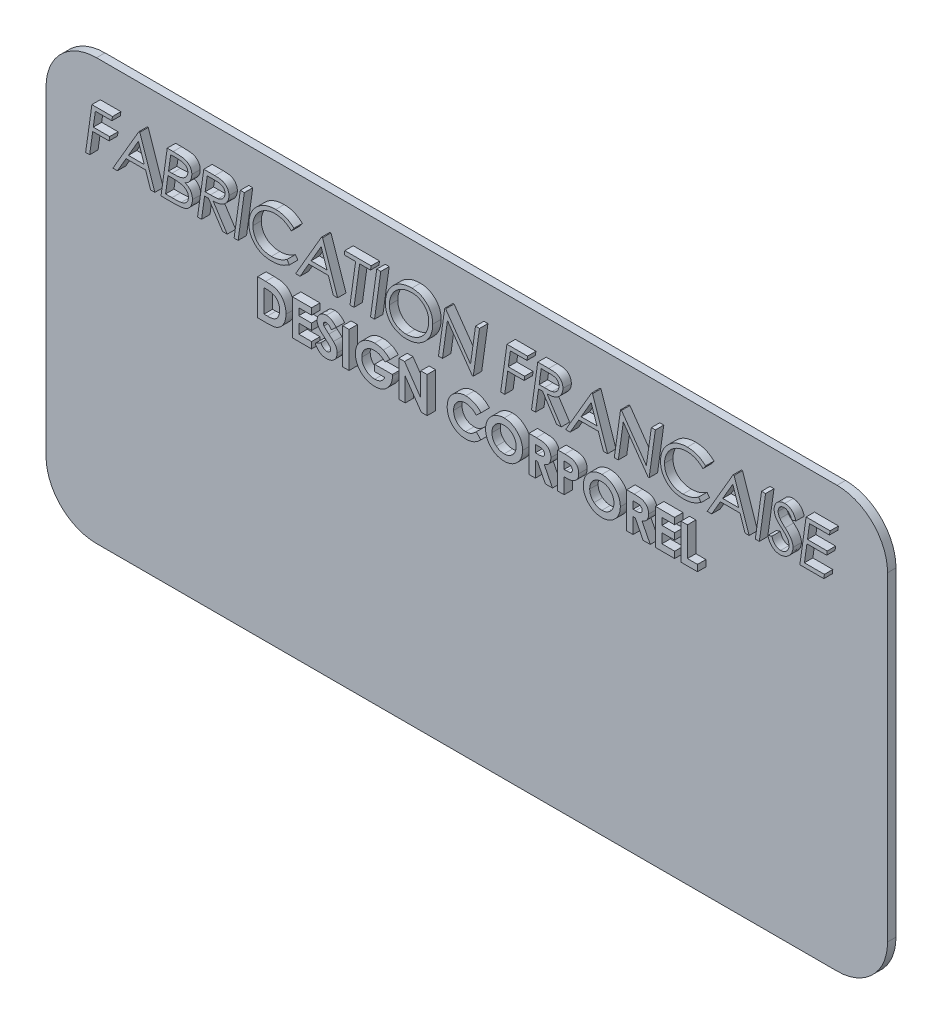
from build123d import *

# Parameters (mm, degrees)
EXTRUSION1_DEPTH = 0.5
EXTRUSION2_DEPTH = 0.5
ESQUISSE3_W      = 0.37991453
ESQUISSE3_H      = 2.116666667
EXTRUSION3_DEPTH = 0.5


with BuildPart() as part:
    # Esquisse1 → Extrusion1 (new body)
    with BuildSketch(Plane.XY):
        with BuildLine():
            Line((-22, -12.5), (22, -12.5))
            ThreePointArc((22, -12.5), (24.121320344, -11.621320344), (25, -9.5))
            Line((25, -9.5), (25, 9.5))
            ThreePointArc((25, 9.5), (24.121320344, 11.621320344), (22, 12.5))
            Line((22, 12.5), (-22, 12.5))
            ThreePointArc((-22, 12.5), (-24.121320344, 11.621320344), (-25, 9.5))
            Line((-25, 9.5), (-25, -9.5))
            ThreePointArc((-25, -9.5), (-24.121320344, -11.621320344), (-22, -12.5))
        make_face()
    extrude(amount=EXTRUSION1_DEPTH)

    # Esquisse2 → Extrusion2 (add)
    # profile 1 of 20: a face of its own
    with BuildSketch(Plane.XY.offset(0.5)):
        Polygon((-20.552369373, 10.449882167), (-20.584700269, 10.212435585), (-21.569997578, 10.212435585), (-21.694021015, 9.330491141), (-20.721974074, 9.330491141), (-20.75430497, 9.09304456), (-21.726881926, 9.09304456), (-21.907616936, 7.804048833), (-22.146653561, 7.804048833), (-21.775643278, 10.449882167), align=None)
    # profile 2 of 20: a face of its own
    with BuildSketch(Plane.XY.offset(0.5)):
        Polygon((-18.927344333, 10.449882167), (-18.033739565, 7.804048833), (-18.282316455, 7.804048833), (-18.580714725, 8.685993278), (-19.745157, 8.685993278), (-20.257681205, 7.804048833), (-20.526928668, 7.804048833), (-18.988296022, 10.449882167), align=None)
        Polygon((-19.008966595, 9.953258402), (-19.60735318, 8.923439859), (-18.661276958, 8.923439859), align=None, mode=Mode.SUBTRACT)
    # profile 3 of 20: a face of its own
    with BuildSketch(Plane.XY.offset(0.5)):
        with BuildLine():
            Line((-17.298079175, 10.449882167), (-16.946149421, 10.449882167))
            add(Edge.make_bspline(
                [(-16.946149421, 10.449882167), (-16.904630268, 10.449647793), (-16.825293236, 10.44919994), (-16.711489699, 10.446687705), (-16.608092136, 10.442090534), (-16.515148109, 10.435163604), (-16.432696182, 10.42710419), (-16.360941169, 10.416388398), (-16.299357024, 10.404801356), (-16.23196021, 10.385986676), (-16.158510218, 10.35511157), (-16.07857441, 10.308563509), (-16.00886853, 10.248721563), (-15.958271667, 10.190777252), (-15.923416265, 10.139927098), (-15.900352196, 10.099706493), (-15.880591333, 10.057790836), (-15.864852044, 10.013899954), (-15.85259256, 9.968318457), (-15.843569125, 9.921220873), (-15.838132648, 9.872294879), (-15.837618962, 9.839142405), (-15.837358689, 9.822344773)],
                knots=[0, 0, 0, 0, 1.713639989, 3.274515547, 4.697934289, 5.984790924, 7.121028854, 8.116168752, 8.97848632, 9.705660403, 11.000241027, 12.255790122, 13.507819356, 14.774100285, 15.41929254, 16.049687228, 16.685791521, 17.329333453, 17.971427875, 18.63213285, 19.30693169, 20, 20, 20, 20], degree=3))
            add(Edge.make_bspline(
                [(-15.837358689, 9.822344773), (-15.838606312, 9.787426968), (-15.841054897, 9.718897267), (-15.862633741, 9.619354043), (-15.896506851, 9.525130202), (-15.944987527, 9.438403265), (-16.003769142, 9.359383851), (-16.074482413, 9.292881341), (-16.153284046, 9.236088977), (-16.212415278, 9.209719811), (-16.242289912, 9.196397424)],
                knots=[0, 0, 0, 0, 1.056823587, 2.074122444, 3.071567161, 4.080224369, 5.073740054, 6.042992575, 7.011269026, 8, 8, 8, 8], degree=3))
            add(Edge.make_bspline(
                [(-16.242289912, 9.196397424), (-16.225598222, 9.190070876), (-16.192645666, 9.177581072), (-16.145095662, 9.155343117), (-16.100810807, 9.129284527), (-16.058826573, 9.100434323), (-16.019974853, 9.068183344), (-15.983337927, 9.033152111), (-15.950840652, 8.993974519), (-15.919882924, 8.95291494), (-15.89238068, 8.908950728), (-15.868603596, 8.862802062), (-15.84814147, 8.814691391), (-15.831942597, 8.764440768), (-15.819106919, 8.712370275), (-15.810302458, 8.658305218), (-15.804039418, 8.602397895), (-15.803639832, 8.564284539), (-15.803437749, 8.54500937)],
                knots=[0, 0, 0, 0, 1.018067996, 2.009858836, 2.989905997, 3.945980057, 4.912461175, 5.86747234, 6.832691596, 7.812272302, 8.799341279, 9.786461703, 10.771006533, 11.778091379, 12.794911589, 13.827097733, 14.901092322, 16, 16, 16, 16], degree=3))
            add(Edge.make_bspline(
                [(-15.803437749, 8.54500937), (-15.803623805, 8.525203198), (-15.803988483, 8.486382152), (-15.810394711, 8.429255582), (-15.819061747, 8.374120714), (-15.831815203, 8.320949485), (-15.848301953, 8.270174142), (-15.867907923, 8.221253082), (-15.891934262, 8.174860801), (-15.927550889, 8.115933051), (-15.979619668, 8.048593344), (-16.053532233, 7.9795857), (-16.137482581, 7.922796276), (-16.21552635, 7.885201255), (-16.285904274, 7.861245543), (-16.348255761, 7.846349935), (-16.419386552, 7.833234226), (-16.499314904, 7.822211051), (-16.588086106, 7.813842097), (-16.685680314, 7.808349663), (-16.792060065, 7.804436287), (-16.865936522, 7.804181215), (-16.90427826, 7.804048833)],
                knots=[0, 0, 0, 0, 0.779883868, 1.52860976, 2.262135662, 2.977977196, 3.68018566, 4.363971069, 5.051959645, 5.735993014, 7.075426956, 8.390346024, 9.703181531, 11.054374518, 11.789582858, 12.628635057, 13.577470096, 14.638659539, 15.806428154, 17.08949324, 18.489452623, 20, 20, 20, 20], degree=3))
            Line((-16.90427826, 7.804048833), (-17.669089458, 7.804048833))
            Line((-17.669089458, 7.804048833), (-17.298079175, 10.449882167))
        make_face()
        with BuildLine():
            Line((-17.092433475, 10.212435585), (-17.220167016, 9.303460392))
            add(Edge.make_bspline(
                [(-17.220167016, 9.303460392), (-17.189260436, 9.301389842), (-17.122909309, 9.296944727), (-17.05640687, 9.296700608), (-17.020881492, 9.296570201)],
                knots=[0, 0, 0, 0, 0.931606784, 2, 2, 2, 2], degree=3))
            add(Edge.make_bspline(
                [(-17.020881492, 9.296570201), (-16.988903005, 9.296815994), (-16.927231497, 9.297290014), (-16.838145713, 9.299708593), (-16.755813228, 9.304673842), (-16.680450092, 9.310556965), (-16.612080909, 9.319297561), (-16.550608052, 9.328943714), (-16.495951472, 9.341142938), (-16.433254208, 9.358984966), (-16.363602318, 9.387358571), (-16.289405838, 9.430399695), (-16.224637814, 9.48163812), (-16.171098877, 9.541463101), (-16.127921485, 9.606729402), (-16.097594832, 9.676759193), (-16.077777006, 9.749704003), (-16.075800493, 9.799780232), (-16.07480527, 9.824994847)],
                knots=[0, 0, 0, 0, 1.258421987, 2.426905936, 3.50630935, 4.503965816, 5.400770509, 6.217970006, 6.951680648, 7.602963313, 8.781660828, 9.900119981, 10.968496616, 12.016986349, 13.046684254, 14.033527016, 15.009832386, 16, 16, 16, 16], degree=3))
            add(Edge.make_bspline(
                [(-16.07480527, 9.824994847), (-16.075385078, 9.841266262), (-16.076506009, 9.872723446), (-16.083120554, 9.918422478), (-16.095827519, 9.960529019), (-16.111590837, 10.000091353), (-16.134156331, 10.035555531), (-16.160696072, 10.06791488), (-16.191689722, 10.097580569), (-16.228761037, 10.123568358), (-16.273796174, 10.14636229), (-16.328708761, 10.165526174), (-16.394274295, 10.181497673), (-16.470193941, 10.195192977), (-16.55691815, 10.20551803), (-16.654359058, 10.212722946), (-16.762729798, 10.216785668), (-16.838552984, 10.217408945), (-16.878307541, 10.217735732)],
                knots=[0, 0, 0, 0, 0.770982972, 1.490525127, 2.17903608, 2.850400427, 3.500570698, 4.160574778, 4.829431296, 5.525930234, 6.296867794, 7.212684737, 8.274122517, 9.490350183, 10.864547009, 12.408691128, 14.117054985, 16, 16, 16, 16], degree=3))
            add(Edge.make_bspline(
                [(-16.878307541, 10.217735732), (-16.893500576, 10.217527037), (-16.925653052, 10.217085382), (-16.976559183, 10.217067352), (-17.032711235, 10.21431115), (-17.071937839, 10.213079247), (-17.092433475, 10.212435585)],
                knots=[0, 0, 0, 0, 0.851215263, 1.80139636, 2.851244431, 4, 4, 4, 4], degree=3))
        make_face(mode=Mode.SUBTRACT)
        with BuildLine():
            Line((-17.254617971, 9.05912362), (-17.396661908, 8.041495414))
            Line((-17.396661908, 8.041495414), (-17.015581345, 8.041495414))
            add(Edge.make_bspline(
                [(-17.015581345, 8.041495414), (-16.983779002, 8.041566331), (-16.922643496, 8.041702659), (-16.834843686, 8.043582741), (-16.754594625, 8.04517595), (-16.682183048, 8.049265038), (-16.617461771, 8.053081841), (-16.560784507, 8.058665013), (-16.511660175, 8.063814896), (-16.48182852, 8.069579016), (-16.46807617, 8.072236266)],
                knots=[0, 0, 0, 0, 1.390128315, 2.672325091, 3.838879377, 4.898285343, 5.842492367, 6.672434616, 7.387994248, 8, 8, 8, 8], degree=3))
            add(Edge.make_bspline(
                [(-16.46807617, 8.072236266), (-16.451066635, 8.076291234), (-16.41769117, 8.084247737), (-16.369693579, 8.099016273), (-16.324616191, 8.115978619), (-16.283173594, 8.135631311), (-16.24421532, 8.15661913), (-16.209623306, 8.181334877), (-16.1772386, 8.207192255), (-16.148747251, 8.236042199), (-16.122868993, 8.266740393), (-16.101431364, 8.300351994), (-16.082632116, 8.335543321), (-16.067130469, 8.372746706), (-16.055503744, 8.412418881), (-16.047238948, 8.454110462), (-16.041592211, 8.497861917), (-16.041123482, 8.527677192), (-16.04088433, 8.542889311)],
                knots=[0, 0, 0, 0, 1.20370812, 2.361870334, 3.455300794, 4.51645333, 5.518362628, 6.49696157, 7.439279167, 8.368233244, 9.284032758, 10.198376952, 11.107120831, 12.028798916, 12.967891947, 13.94837913, 14.953237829, 16, 16, 16, 16], degree=3))
            add(Edge.make_bspline(
                [(-16.04088433, 8.542889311), (-16.04180742, 8.569650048), (-16.043599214, 8.621594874), (-16.060112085, 8.695944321), (-16.088253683, 8.763130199), (-16.120614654, 8.813448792), (-16.152773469, 8.849300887), (-16.179595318, 8.875814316), (-16.211363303, 8.89893818), (-16.245182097, 8.922539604), (-16.283719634, 8.942540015), (-16.325047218, 8.962498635), (-16.370269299, 8.980364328), (-16.419418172, 8.996899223), (-16.4733052, 9.01193751), (-16.53303188, 9.024323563), (-16.598721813, 9.035733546), (-16.67097464, 9.043714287), (-16.749260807, 9.050548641), (-16.833715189, 9.056102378), (-16.924406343, 9.058363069), (-16.986960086, 9.058864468), (-17.019291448, 9.05912362)],
                knots=[0, 0, 0, 0, 1.286382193, 2.496975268, 3.639964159, 4.776391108, 5.354547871, 5.955741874, 6.586497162, 7.241915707, 7.937968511, 8.671820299, 9.450019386, 10.275265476, 11.166193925, 12.139859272, 13.208926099, 14.372962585, 15.635875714, 16.990120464, 18.444321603, 20, 20, 20, 20], degree=3))
            Line((-17.019291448, 9.05912362), (-17.254617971, 9.05912362))
        make_face(mode=Mode.SUBTRACT)
    # profile 4 of 20: a face of its own
    with BuildSketch(Plane.XY.offset(0.5)):
        with BuildLine():
            Line((-15.127139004, 10.449882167), (-14.472040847, 10.449882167))
            add(Edge.make_bspline(
                [(-14.472040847, 10.449882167), (-14.443945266, 10.449713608), (-14.38967841, 10.449388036), (-14.311583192, 10.445939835), (-14.239562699, 10.44171503), (-14.174040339, 10.433955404), (-14.114284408, 10.425478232), (-14.061094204, 10.41371518), (-14.013846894, 10.400708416), (-13.959697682, 10.380286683), (-13.898777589, 10.348472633), (-13.833292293, 10.300077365), (-13.775147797, 10.241761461), (-13.725081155, 10.17436446), (-13.683235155, 10.099702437), (-13.653626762, 10.017930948), (-13.635597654, 9.930194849), (-13.633549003, 9.869781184), (-13.632497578, 9.838775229)],
                knots=[0, 0, 0, 0, 1.135235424, 2.192716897, 3.158659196, 4.049554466, 4.858312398, 5.596287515, 6.249404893, 6.836824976, 7.932117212, 9.014466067, 10.114981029, 11.247271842, 12.39767117, 13.560848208, 14.748160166, 16, 16, 16, 16], degree=3))
            add(Edge.make_bspline(
                [(-13.632497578, 9.838775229), (-13.633694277, 9.804551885), (-13.636069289, 9.736631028), (-13.659096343, 9.637120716), (-13.694673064, 9.541200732), (-13.744590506, 9.450544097), (-13.806108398, 9.366941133), (-13.879188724, 9.293439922), (-13.96249456, 9.230680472), (-14.040655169, 9.189263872), (-14.107977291, 9.16076717), (-14.16336941, 9.14335315), (-14.22202517, 9.126872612), (-14.285102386, 9.115352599), (-14.351661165, 9.104897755), (-14.422295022, 9.098390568), (-14.496542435, 9.094000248), (-14.54729597, 9.093368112), (-14.573273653, 9.09304456)],
                knots=[0, 0, 0, 0, 1.212475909, 2.406322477, 3.604324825, 4.83292766, 6.065250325, 7.275244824, 8.497515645, 9.751142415, 10.403020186, 11.088849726, 11.80956709, 12.563116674, 13.361820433, 14.199444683, 15.078403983, 16, 16, 16, 16], degree=3))
            Line((-14.573273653, 9.09304456), (-13.734260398, 7.804048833))
            Line((-13.734260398, 7.804048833), (-14.00562792, 7.804048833))
            Line((-14.00562792, 7.804048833), (-14.844641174, 9.09304456))
            Line((-14.844641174, 9.09304456), (-15.078377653, 9.09304456))
            Line((-15.078377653, 9.09304456), (-15.259112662, 7.804048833))
            Line((-15.259112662, 7.804048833), (-15.498149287, 7.804048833))
            Line((-15.498149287, 7.804048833), (-15.127139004, 10.449882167))
        make_face()
        with BuildLine():
            Line((-14.921493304, 10.212435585), (-15.044986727, 9.330491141))
            Line((-15.044986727, 9.330491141), (-14.730158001, 9.330491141))
            add(Edge.make_bspline(
                [(-14.730158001, 9.330491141), (-14.702243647, 9.33063481), (-14.648886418, 9.330909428), (-14.572731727, 9.331817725), (-14.504162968, 9.333821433), (-14.443222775, 9.33716463), (-14.389628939, 9.340512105), (-14.343715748, 9.345449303), (-14.305211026, 9.35020488), (-14.282446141, 9.355254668), (-14.272225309, 9.35752189)],
                knots=[0, 0, 0, 0, 1.458162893, 2.787223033, 3.978296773, 5.04104012, 5.975374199, 6.782555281, 7.453399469, 8, 8, 8, 8], degree=3))
            add(Edge.make_bspline(
                [(-14.272225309, 9.35752189), (-14.243265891, 9.365416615), (-14.186575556, 9.380871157), (-14.108846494, 9.419513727), (-14.038941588, 9.467002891), (-13.988930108, 9.515859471), (-13.954347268, 9.559342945), (-13.932042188, 9.594089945), (-13.912747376, 9.630372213), (-13.896846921, 9.668484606), (-13.884573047, 9.708425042), (-13.876265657, 9.750169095), (-13.870677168, 9.793572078), (-13.87019086, 9.823210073), (-13.869944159, 9.838245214)],
                knots=[0, 0, 0, 0, 1.585234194, 3.103220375, 4.568605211, 6.043119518, 6.782020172, 7.505617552, 8.225034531, 8.954348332, 9.687845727, 10.432345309, 11.204740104, 12, 12, 12, 12], degree=3))
            add(Edge.make_bspline(
                [(-13.869944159, 9.838245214), (-13.870528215, 9.854871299), (-13.8716642, 9.88720894), (-13.878281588, 9.934104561), (-13.890590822, 9.977349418), (-13.907545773, 10.017008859), (-13.929638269, 10.052963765), (-13.956260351, 10.085528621), (-13.987923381, 10.114565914), (-14.011933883, 10.130591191), (-14.024178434, 10.138763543)],
                knots=[0, 0, 0, 0, 1.12641054, 2.190862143, 3.198439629, 4.163183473, 5.103118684, 6.046930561, 7.004000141, 8, 8, 8, 8], degree=3))
            add(Edge.make_bspline(
                [(-14.024178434, 10.138763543), (-14.034990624, 10.144892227), (-14.057838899, 10.157843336), (-14.097146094, 10.172064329), (-14.141705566, 10.184932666), (-14.192482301, 10.194671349), (-14.249096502, 10.202522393), (-14.311710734, 10.208167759), (-14.380122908, 10.212044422), (-14.427690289, 10.212301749), (-14.452430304, 10.212435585)],
                knots=[0, 0, 0, 0, 0.678253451, 1.433282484, 2.276919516, 3.212490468, 4.255879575, 5.400330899, 6.647900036, 8, 8, 8, 8], degree=3))
            Line((-14.452430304, 10.212435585), (-14.921493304, 10.212435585))
        make_face(mode=Mode.SUBTRACT)
    # profile 5 of 20: a face of its own
    with BuildSketch(Plane.XY.offset(0.5)):
        Polygon((-12.956198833, 10.449882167), (-12.717162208, 10.449882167), (-13.088172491, 7.804048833), (-13.327209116, 7.804048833), align=None)
    # profile 6 of 20: a face of its own
    with BuildSketch(Plane.XY.offset(0.5)):
        with BuildLine():
            Line((-9.765510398, 10.093712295), (-9.924514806, 9.873226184))
            add(Edge.make_bspline(
                [(-9.924514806, 9.873226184), (-9.960012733, 9.905668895), (-10.029644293, 9.969307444), (-10.141790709, 10.0523896), (-10.257616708, 10.122754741), (-10.377289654, 10.180213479), (-10.500602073, 10.22529688), (-10.627637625, 10.256860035), (-10.758483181, 10.276754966), (-10.847022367, 10.279094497), (-10.891791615, 10.280277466)],
                knots=[0, 0, 0, 0, 1.071509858, 2.101838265, 3.105566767, 4.088534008, 5.056617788, 6.027134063, 7.002433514, 8, 8, 8, 8], degree=3))
            add(Edge.make_bspline(
                [(-10.891791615, 10.280277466), (-10.921135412, 10.279763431), (-10.979401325, 10.27874275), (-11.066020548, 10.270704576), (-11.150965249, 10.256819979), (-11.234515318, 10.237661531), (-11.316661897, 10.213265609), (-11.39752911, 10.183655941), (-11.476644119, 10.147784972), (-11.553981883, 10.107276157), (-11.628745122, 10.062499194), (-11.699066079, 10.013006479), (-11.765840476, 9.960367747), (-11.828351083, 9.903862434), (-11.886198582, 9.842927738), (-11.94051442, 9.779055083), (-11.989750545, 9.710673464), (-12.035268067, 9.639478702), (-12.075918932, 9.565694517), (-12.111049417, 9.490037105), (-12.140832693, 9.413026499), (-12.165181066, 9.334560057), (-12.184361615, 9.254720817), (-12.198244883, 9.173477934), (-12.206267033, 9.090734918), (-12.207299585, 9.035113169), (-12.207818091, 9.00718218)],
                knots=[0, 0, 0, 0, 1.038808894, 2.06268977, 3.07662516, 4.084154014, 5.095481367, 6.108721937, 7.130613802, 8.168612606, 9.198437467, 10.213568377, 11.210969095, 12.207329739, 13.193903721, 14.183803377, 15.173465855, 16.174683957, 17.174102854, 18.153572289, 19.125845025, 20.09527659, 21.060177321, 22.030919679, 23.011207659, 24, 24, 24, 24], degree=3))
            add(Edge.make_bspline(
                [(-12.207818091, 9.00718218), (-12.207439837, 8.982431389), (-12.206692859, 8.933553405), (-12.199890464, 8.861398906), (-12.190335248, 8.791163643), (-12.175047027, 8.723334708), (-12.156790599, 8.657100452), (-12.133312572, 8.593317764), (-12.106249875, 8.531444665), (-12.075079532, 8.471982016), (-12.039258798, 8.415521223), (-12.000997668, 8.361022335), (-11.957638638, 8.310877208), (-11.911274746, 8.263237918), (-11.861134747, 8.218702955), (-11.806592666, 8.178172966), (-11.749455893, 8.139368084), (-11.687824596, 8.105619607), (-11.624040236, 8.073808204), (-11.556916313, 8.047777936), (-11.488044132, 8.024669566), (-11.416602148, 8.006341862), (-11.343095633, 7.991152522), (-11.267055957, 7.981583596), (-11.189076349, 7.974782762), (-11.136320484, 7.974032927), (-11.109627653, 7.973653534)],
                knots=[0, 0, 0, 0, 1.050288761, 2.074115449, 3.074185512, 4.056755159, 5.022963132, 5.98847243, 6.938717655, 7.888015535, 8.834733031, 9.775342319, 10.711547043, 11.644864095, 12.595819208, 13.554196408, 14.527565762, 15.524707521, 16.534208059, 17.550758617, 18.577574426, 19.616152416, 20.679451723, 21.761233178, 22.867253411, 24, 24, 24, 24], degree=3))
            add(Edge.make_bspline(
                [(-11.109627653, 7.973653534), (-11.068598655, 7.9745668), (-10.986821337, 7.976387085), (-10.865402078, 7.991154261), (-10.746109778, 8.014965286), (-10.629016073, 8.048663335), (-10.513890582, 8.091474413), (-10.401099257, 8.144596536), (-10.289967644, 8.206147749), (-10.219365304, 8.254507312), (-10.183691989, 8.278941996)],
                knots=[0, 0, 0, 0, 0.99335309, 1.979910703, 2.957437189, 3.936535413, 4.927536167, 5.928599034, 6.953381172, 8, 8, 8, 8], degree=3))
            Line((-10.183691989, 8.278941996), (-10.03687792, 8.069586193))
            add(Edge.make_bspline(
                [(-10.03687792, 8.069586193), (-10.062388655, 8.053683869), (-10.112281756, 8.0225826), (-10.187048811, 7.980088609), (-10.258399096, 7.940632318), (-10.327169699, 7.905487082), (-10.3931552, 7.874085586), (-10.456792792, 7.847267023), (-10.517231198, 7.82355814), (-10.595288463, 7.797824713), (-10.695605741, 7.772928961), (-10.821863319, 7.751170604), (-10.957077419, 7.738496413), (-11.050062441, 7.736985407), (-11.09796733, 7.736206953)],
                knots=[0, 0, 0, 0, 0.95718736, 1.872037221, 2.738173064, 3.553405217, 4.331061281, 5.064628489, 5.752111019, 6.397930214, 7.680580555, 9.03930081, 10.474679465, 12, 12, 12, 12], degree=3))
            add(Edge.make_bspline(
                [(-11.09796733, 7.736206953), (-11.142528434, 7.73691313), (-11.229736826, 7.738295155), (-11.357184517, 7.752263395), (-11.478418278, 7.772686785), (-11.593135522, 7.803479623), (-11.702053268, 7.841549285), (-11.804004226, 7.889948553), (-11.900588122, 7.9450782), (-11.959159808, 7.989596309), (-11.988392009, 8.011814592)],
                knots=[0, 0, 0, 0, 1.124936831, 2.201559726, 3.234383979, 4.226808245, 5.197736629, 6.143845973, 7.073622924, 8, 8, 8, 8], degree=3))
            add(Edge.make_bspline(
                [(-11.988392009, 8.011814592), (-12.006911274, 8.027371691), (-12.043616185, 8.058205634), (-12.095667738, 8.106994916), (-12.144041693, 8.157918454), (-12.188574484, 8.211198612), (-12.230026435, 8.265959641), (-12.266975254, 8.3231346), (-12.301473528, 8.381498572), (-12.331081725, 8.442439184), (-12.358745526, 8.504743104), (-12.381742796, 8.569318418), (-12.401565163, 8.635805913), (-12.417252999, 8.704378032), (-12.430103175, 8.774733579), (-12.43903428, 8.847106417), (-12.444482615, 8.921234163), (-12.445002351, 8.971308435), (-12.445264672, 8.996581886)],
                knots=[0, 0, 0, 0, 1.031438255, 2.044295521, 3.04101972, 4.02510288, 5.004675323, 5.96814667, 6.927099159, 7.894246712, 8.855978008, 9.833229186, 10.815522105, 11.813498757, 12.831862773, 13.86462134, 14.922233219, 16, 16, 16, 16], degree=3))
            add(Edge.make_bspline(
                [(-12.445264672, 8.996581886), (-12.445000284, 9.022738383), (-12.444474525, 9.074753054), (-12.438998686, 9.152052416), (-12.430109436, 9.227956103), (-12.417201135, 9.302185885), (-12.401479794, 9.374967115), (-12.3818102, 9.446090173), (-12.358403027, 9.51578331), (-12.331302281, 9.583975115), (-12.301220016, 9.651008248), (-12.267054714, 9.716087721), (-12.230119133, 9.780120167), (-12.188531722, 9.841874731), (-12.143844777, 9.902565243), (-12.095891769, 9.961944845), (-12.043467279, 10.019056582), (-11.98886203, 10.075135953), (-11.931145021, 10.128497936), (-11.8714424, 10.178837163), (-11.809700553, 10.225452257), (-11.746676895, 10.269240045), (-11.681538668, 10.308713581), (-11.614900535, 10.345055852), (-11.546424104, 10.377925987), (-11.476208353, 10.407477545), (-11.404288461, 10.43373466), (-11.330564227, 10.455755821), (-11.255077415, 10.474951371), (-11.177987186, 10.490806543), (-11.099109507, 10.503136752), (-11.018423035, 10.511334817), (-10.936039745, 10.51696723), (-10.880494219, 10.517470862), (-10.852570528, 10.517724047)],
                knots=[0, 0, 0, 0, 1.022044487, 2.032432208, 3.026697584, 4.007398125, 4.975698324, 5.935493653, 6.889610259, 7.847342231, 8.802158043, 9.759466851, 10.718641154, 11.689497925, 12.667180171, 13.663528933, 14.670419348, 15.695700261, 16.721678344, 17.740943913, 18.746223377, 19.744006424, 20.738655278, 21.721128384, 22.709310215, 23.705658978, 24.697235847, 25.699785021, 26.711210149, 27.740296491, 28.77439654, 29.829646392, 30.908925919, 32, 32, 32, 32], degree=3))
            add(Edge.make_bspline(
                [(-10.852570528, 10.517724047), (-10.801984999, 10.516703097), (-10.702951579, 10.51470434), (-10.557848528, 10.496111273), (-10.419693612, 10.466307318), (-10.309533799, 10.430425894), (-10.224012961, 10.395416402), (-10.159353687, 10.36550256), (-10.094851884, 10.330052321), (-10.029449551, 10.291432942), (-9.963793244, 10.24852111), (-9.897787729, 10.200963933), (-9.831315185, 10.149332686), (-9.787642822, 10.112419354), (-9.765510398, 10.093712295)],
                knots=[0, 0, 0, 0, 1.522680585, 2.981015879, 4.397098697, 5.773315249, 6.462902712, 7.179304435, 7.917249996, 8.678195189, 9.466166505, 10.278195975, 11.127418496, 12, 12, 12, 12], degree=3))
        make_face()
    # profile 7 of 20: a face of its own
    with BuildSketch(Plane.XY.offset(0.5)):
        Polygon((-8.072643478, 10.449882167), (-7.17903871, 7.804048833), (-7.4276156, 7.804048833), (-7.726013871, 8.685993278), (-8.890456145, 8.685993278), (-9.40298035, 7.804048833), (-9.672227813, 7.804048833), (-8.133595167, 10.449882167), align=None)
        Polygon((-8.15426574, 9.953258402), (-8.752652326, 8.923439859), (-7.806576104, 8.923439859), align=None, mode=Mode.SUBTRACT)
    # profile 8 of 20: a face of its own
    with BuildSketch(Plane.XY.offset(0.5)):
        Polygon((-6.746546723, 10.449882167), (-5.186183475, 10.449882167), (-5.220104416, 10.212435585), (-5.866722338, 10.212435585), (-6.202221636, 7.804048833), (-6.441258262, 7.804048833), (-6.105758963, 10.212435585), (-6.780467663, 10.212435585), align=None)
    # profile 9 of 20: a face of its own
    with BuildSketch(Plane.XY.offset(0.5)):
        Polygon((-4.849094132, 10.449882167), (-4.610057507, 10.449882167), (-4.98106779, 7.804048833), (-5.220104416, 7.804048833), align=None)
    # profile 10 of 20: a face of its own
    with BuildSketch(Plane.XY.offset(0.5)):
        with BuildLine():
            add(Edge.make_bspline(
                [(-2.759776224, 10.517724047), (-2.7164382, 10.516780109), (-2.631205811, 10.514923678), (-2.506246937, 10.498082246), (-2.386737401, 10.47062372), (-2.272949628, 10.431765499), (-2.164546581, 10.382211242), (-2.061774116, 10.32158315), (-1.965024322, 10.249349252), (-1.874315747, 10.167758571), (-1.7919756, 10.077674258), (-1.719997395, 9.980624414), (-1.658829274, 9.878035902), (-1.608343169, 9.769704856), (-1.570426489, 9.655007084), (-1.543080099, 9.534859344), (-1.525293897, 9.408932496), (-1.523590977, 9.322955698), (-1.522721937, 9.279079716)],
                knots=[0, 0, 0, 0, 1.061681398, 2.087996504, 3.083659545, 4.062660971, 5.02945529, 5.999994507, 6.981138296, 7.983640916, 8.985844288, 9.966988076, 10.939736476, 11.908342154, 12.890058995, 13.894159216, 14.925339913, 16, 16, 16, 16], degree=3))
            add(Edge.make_bspline(
                [(-1.522721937, 9.279079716), (-1.522981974, 9.2520404), (-1.523495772, 9.198614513), (-1.528970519, 9.119190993), (-1.538030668, 9.04158552), (-1.55003903, 8.965463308), (-1.566167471, 8.891257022), (-1.585029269, 8.818444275), (-1.608044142, 8.747447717), (-1.633889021, 8.677806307), (-1.663625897, 8.609858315), (-1.697166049, 8.543667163), (-1.733687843, 8.478768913), (-1.774082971, 8.415640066), (-1.817992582, 8.354278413), (-1.86555289, 8.294622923), (-1.916149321, 8.236460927), (-1.970341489, 8.180466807), (-2.026539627, 8.126447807), (-2.085397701, 8.076380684), (-2.145593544, 8.029373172), (-2.207520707, 7.985760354), (-2.271726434, 7.946337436), (-2.337171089, 7.909442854), (-2.404218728, 7.875938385), (-2.473476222, 7.846985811), (-2.544164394, 7.820842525), (-2.616489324, 7.798103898), (-2.690652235, 7.779025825), (-2.766472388, 7.762991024), (-2.844154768, 7.750897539), (-2.923587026, 7.742575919), (-3.004561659, 7.736956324), (-3.059224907, 7.736458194), (-3.086795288, 7.736206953)],
                knots=[0, 0, 0, 0, 1.057694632, 2.089855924, 3.112648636, 4.113725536, 5.103331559, 6.082381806, 7.055068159, 8.021768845, 8.98743121, 9.954922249, 10.923671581, 11.89959402, 12.885451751, 13.874212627, 14.883322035, 15.900071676, 16.921812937, 17.931632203, 18.921551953, 19.909055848, 20.892997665, 21.867769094, 22.84762411, 23.823252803, 24.802912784, 25.795362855, 26.787788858, 27.797679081, 28.826061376, 29.861826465, 30.921574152, 32, 32, 32, 32], degree=3))
            add(Edge.make_bspline(
                [(-3.086795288, 7.736206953), (-3.133126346, 7.737192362), (-3.223600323, 7.739116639), (-3.355670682, 7.755060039), (-3.480416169, 7.782431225), (-3.598632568, 7.819029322), (-3.709430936, 7.867603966), (-3.813000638, 7.926802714), (-3.909427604, 7.996691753), (-3.998369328, 8.076535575), (-4.078016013, 8.165424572), (-4.148058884, 8.26108948), (-4.206534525, 8.363887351), (-4.255285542, 8.47288032), (-4.29185995, 8.58899872), (-4.319271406, 8.71107934), (-4.335238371, 8.839979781), (-4.337171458, 8.928165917), (-4.338159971, 8.97326124)],
                knots=[0, 0, 0, 0, 1.121422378, 2.189881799, 3.214223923, 4.209829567, 5.180887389, 6.136870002, 7.092517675, 8.058664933, 9.02481219, 9.976998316, 10.923432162, 11.882748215, 12.86205079, 13.865508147, 14.908495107, 16, 16, 16, 16], degree=3))
            add(Edge.make_bspline(
                [(-4.338159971, 8.97326124), (-4.33756351, 9.008441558), (-4.336380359, 9.078225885), (-4.326466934, 9.181775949), (-4.310864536, 9.283309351), (-4.287801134, 9.382345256), (-4.259077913, 9.479374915), (-4.224372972, 9.574335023), (-4.182013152, 9.666609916), (-4.134495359, 9.75665545), (-4.081448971, 9.84337555), (-4.022002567, 9.924911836), (-3.959311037, 10.002828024), (-3.890307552, 10.075042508), (-3.816902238, 10.142750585), (-3.738525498, 10.205720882), (-3.655168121, 10.26343938), (-3.567292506, 10.316226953), (-3.476045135, 10.36409557), (-3.381210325, 10.40472274), (-3.284144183, 10.43989983), (-3.184337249, 10.468715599), (-3.081676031, 10.490141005), (-2.976775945, 10.506117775), (-2.869147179, 10.515953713), (-2.796544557, 10.517128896), (-2.759776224, 10.517724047)],
                knots=[0, 0, 0, 0, 1.027038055, 2.037251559, 3.03463374, 4.024476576, 5.003805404, 5.987972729, 6.973761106, 7.966047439, 8.95963362, 9.938921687, 10.910571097, 11.877553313, 12.852319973, 13.824735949, 14.81069978, 15.81041387, 16.816403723, 17.816876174, 18.82042938, 19.829469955, 20.847307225, 21.880377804, 22.926554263, 24, 24, 24, 24], degree=3))
        make_face()
        with BuildLine():
            add(Edge.make_bspline(
                [(-2.759776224, 10.280277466), (-2.791420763, 10.279802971), (-2.853927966, 10.278865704), (-2.946421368, 10.270364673), (-3.036497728, 10.258314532), (-3.123748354, 10.239113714), (-3.208677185, 10.216443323), (-3.290515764, 10.186630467), (-3.370225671, 10.153010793), (-3.446980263, 10.11366502), (-3.520525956, 10.069862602), (-3.59034856, 10.021396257), (-3.656092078, 9.968457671), (-3.717685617, 9.910696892), (-3.776170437, 9.849615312), (-3.829886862, 9.783275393), (-3.879663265, 9.712712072), (-3.925487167, 9.638358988), (-3.966866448, 9.561324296), (-4.002252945, 9.482186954), (-4.032557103, 9.402024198), (-4.057675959, 9.320850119), (-4.076741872, 9.238266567), (-4.090393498, 9.154525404), (-4.099363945, 9.069388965), (-4.10026147, 9.012151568), (-4.10071339, 8.983331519)],
                knots=[0, 0, 0, 0, 1.093710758, 2.16039807, 3.20900896, 4.233234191, 5.246749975, 6.245527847, 7.241594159, 8.235879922, 9.224691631, 10.198908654, 11.171861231, 12.139893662, 13.116290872, 14.093089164, 15.087825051, 16.099756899, 17.110766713, 18.108591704, 19.094380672, 20.071961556, 21.043859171, 22.021859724, 23.00397114, 24, 24, 24, 24], degree=3))
            add(Edge.make_bspline(
                [(-4.10071339, 8.983331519), (-4.10026119, 8.959117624), (-4.099365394, 8.911150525), (-4.093590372, 8.840145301), (-4.083392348, 8.771161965), (-4.069697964, 8.704019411), (-4.051753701, 8.638810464), (-4.029231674, 8.575566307), (-4.003361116, 8.514087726), (-3.973753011, 8.454696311), (-3.94034838, 8.39810311), (-3.903912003, 8.344457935), (-3.864040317, 8.2946585), (-3.82142342, 8.248192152), (-3.775678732, 8.20520591), (-3.726976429, 8.165269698), (-3.674762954, 8.129418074), (-3.620117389, 8.096244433), (-3.562496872, 8.067255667), (-3.502218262, 8.042259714), (-3.439521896, 8.02108028), (-3.374417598, 8.003517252), (-3.306725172, 7.990379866), (-3.236650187, 7.980896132), (-3.164102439, 7.974952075), (-3.114897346, 7.974090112), (-3.089975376, 7.973653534)],
                knots=[0, 0, 0, 0, 1.083699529, 2.146780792, 3.185591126, 4.202843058, 5.211856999, 6.209655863, 7.20532214, 8.195415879, 9.177202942, 10.14436246, 11.095191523, 12.029705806, 12.963818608, 13.902338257, 14.845476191, 15.796042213, 16.761390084, 17.729066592, 18.714222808, 19.721158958, 20.74459932, 21.797962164, 22.884686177, 24, 24, 24, 24], degree=3))
            add(Edge.make_bspline(
                [(-3.089975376, 7.973653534), (-3.060092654, 7.97408222), (-3.000910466, 7.974931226), (-2.913025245, 7.98418325), (-2.826666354, 7.996795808), (-2.741996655, 8.01640835), (-2.658751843, 8.040346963), (-2.577622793, 8.071114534), (-2.497669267, 8.105839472), (-2.420160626, 8.146806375), (-2.345171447, 8.191849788), (-2.274338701, 8.242071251), (-2.207647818, 8.296303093), (-2.144057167, 8.353808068), (-2.086022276, 8.416735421), (-2.031465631, 8.483312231), (-1.981353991, 8.554266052), (-1.935250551, 8.628920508), (-1.894038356, 8.706408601), (-1.858515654, 8.786192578), (-1.828233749, 8.867439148), (-1.803216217, 8.950058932), (-1.784075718, 9.034390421), (-1.770497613, 9.120086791), (-1.761498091, 9.207512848), (-1.760614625, 9.266336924), (-1.760168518, 9.296040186)],
                knots=[0, 0, 0, 0, 1.029812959, 2.039525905, 3.043952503, 4.036919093, 5.033391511, 6.027870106, 7.026035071, 8.036794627, 9.047957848, 10.039952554, 11.027355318, 12.010276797, 12.992858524, 13.975534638, 14.976019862, 15.985163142, 16.99876328, 17.999396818, 18.993875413, 19.986244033, 20.973271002, 21.972624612, 22.976275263, 24, 24, 24, 24], degree=3))
            add(Edge.make_bspline(
                [(-1.760168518, 9.296040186), (-1.761211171, 9.334599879), (-1.763252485, 9.410092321), (-1.778504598, 9.520388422), (-1.805410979, 9.624114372), (-1.841213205, 9.722281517), (-1.888821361, 9.813731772), (-1.946627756, 9.89920742), (-2.014509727, 9.979040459), (-2.067323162, 10.025603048), (-2.094077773, 10.049191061)],
                knots=[0, 0, 0, 0, 1.085318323, 2.124844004, 3.126009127, 4.096923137, 5.060061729, 6.020100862, 6.997008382, 8, 8, 8, 8], degree=3))
            add(Edge.make_bspline(
                [(-2.094077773, 10.049191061), (-2.117430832, 10.06765515), (-2.163906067, 10.104400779), (-2.238956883, 10.151374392), (-2.317115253, 10.191417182), (-2.39896229, 10.223922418), (-2.484258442, 10.249365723), (-2.573127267, 10.267317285), (-2.665343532, 10.278101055), (-2.727946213, 10.279543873), (-2.759776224, 10.280277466)],
                knots=[0, 0, 0, 0, 0.992364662, 1.974918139, 2.947382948, 3.917989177, 4.907989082, 5.912266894, 6.938502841, 8, 8, 8, 8], degree=3))
        make_face(mode=Mode.SUBTRACT)
    # profile 11 of 20: a face of its own
    with BuildSketch(Plane.XY.offset(0.5)):
        Polygon((1.017638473, 10.449882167), (1.256675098, 10.449882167), (0.885664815, 7.804048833), (0.828423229, 7.804048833), (-0.649257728, 9.909797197), (-0.94447591, 7.804048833), (-1.183512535, 7.804048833), (-0.812502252, 10.449882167), (-0.755260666, 10.449882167), (0.721890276, 8.344663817), align=None)
    # profile 12 of 20: a face of its own
    with BuildSketch(Plane.XY.offset(0.5)):
        Polygon((4.108154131, 10.449882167), (4.075823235, 10.212435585), (3.090525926, 10.212435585), (2.966502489, 9.330491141), (3.938549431, 9.330491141), (3.906218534, 9.09304456), (2.933641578, 9.09304456), (2.752906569, 7.804048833), (2.513869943, 7.804048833), (2.884880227, 10.449882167), align=None)
    # profile 13 of 20: a face of its own
    with BuildSketch(Plane.XY.offset(0.5)):
        with BuildLine():
            Line((4.716610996, 10.449882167), (5.371709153, 10.449882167))
            add(Edge.make_bspline(
                [(5.371709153, 10.449882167), (5.399804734, 10.449713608), (5.45407159, 10.449388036), (5.532166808, 10.445939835), (5.604187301, 10.44171503), (5.669709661, 10.433955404), (5.729465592, 10.425478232), (5.782655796, 10.41371518), (5.829903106, 10.400708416), (5.884052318, 10.380286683), (5.944972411, 10.348472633), (6.010457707, 10.300077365), (6.068602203, 10.241761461), (6.118668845, 10.17436446), (6.160514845, 10.099702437), (6.190123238, 10.017930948), (6.208152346, 9.930194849), (6.210200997, 9.869781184), (6.211252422, 9.838775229)],
                knots=[0, 0, 0, 0, 1.135235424, 2.192716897, 3.158659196, 4.049554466, 4.858312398, 5.596287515, 6.249404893, 6.836824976, 7.932117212, 9.014466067, 10.114981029, 11.247271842, 12.39767117, 13.560848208, 14.748160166, 16, 16, 16, 16], degree=3))
            add(Edge.make_bspline(
                [(6.211252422, 9.838775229), (6.210055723, 9.804551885), (6.207680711, 9.736631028), (6.184653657, 9.637120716), (6.149076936, 9.541200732), (6.099159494, 9.450544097), (6.037641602, 9.366941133), (5.964561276, 9.293439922), (5.88125544, 9.230680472), (5.803094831, 9.189263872), (5.735772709, 9.16076717), (5.68038059, 9.14335315), (5.62172483, 9.126872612), (5.558647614, 9.115352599), (5.492088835, 9.104897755), (5.421454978, 9.098390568), (5.347207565, 9.094000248), (5.29645403, 9.093368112), (5.270476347, 9.09304456)],
                knots=[0, 0, 0, 0, 1.212475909, 2.406322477, 3.604324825, 4.83292766, 6.065250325, 7.275244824, 8.497515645, 9.751142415, 10.403020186, 11.088849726, 11.80956709, 12.563116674, 13.361820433, 14.199444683, 15.078403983, 16, 16, 16, 16], degree=3))
            Line((5.270476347, 9.09304456), (6.109489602, 7.804048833))
            Line((6.109489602, 7.804048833), (5.83812208, 7.804048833))
            Line((5.83812208, 7.804048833), (4.999108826, 9.09304456))
            Line((4.999108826, 9.09304456), (4.765372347, 9.09304456))
            Line((4.765372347, 9.09304456), (4.584637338, 7.804048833))
            Line((4.584637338, 7.804048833), (4.345600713, 7.804048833))
            Line((4.345600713, 7.804048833), (4.716610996, 10.449882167))
        make_face()
        with BuildLine():
            Line((4.922256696, 10.212435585), (4.798763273, 9.330491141))
            Line((4.798763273, 9.330491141), (5.113591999, 9.330491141))
            add(Edge.make_bspline(
                [(5.113591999, 9.330491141), (5.141506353, 9.33063481), (5.194863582, 9.330909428), (5.271018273, 9.331817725), (5.339587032, 9.333821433), (5.400527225, 9.33716463), (5.454121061, 9.340512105), (5.500034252, 9.345449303), (5.538538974, 9.35020488), (5.561303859, 9.355254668), (5.571524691, 9.35752189)],
                knots=[0, 0, 0, 0, 1.458162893, 2.787223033, 3.978296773, 5.04104012, 5.975374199, 6.782555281, 7.453399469, 8, 8, 8, 8], degree=3))
            add(Edge.make_bspline(
                [(5.571524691, 9.35752189), (5.600484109, 9.365416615), (5.657174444, 9.380871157), (5.734903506, 9.419513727), (5.804808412, 9.467002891), (5.854819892, 9.515859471), (5.889402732, 9.559342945), (5.911707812, 9.594089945), (5.931002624, 9.630372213), (5.946903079, 9.668484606), (5.959176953, 9.708425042), (5.967484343, 9.750169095), (5.973072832, 9.793572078), (5.97355914, 9.823210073), (5.973805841, 9.838245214)],
                knots=[0, 0, 0, 0, 1.585234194, 3.103220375, 4.568605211, 6.043119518, 6.782020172, 7.505617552, 8.225034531, 8.954348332, 9.687845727, 10.432345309, 11.204740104, 12, 12, 12, 12], degree=3))
            add(Edge.make_bspline(
                [(5.973805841, 9.838245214), (5.973221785, 9.854871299), (5.9720858, 9.88720894), (5.965468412, 9.934104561), (5.953159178, 9.977349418), (5.936204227, 10.017008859), (5.914111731, 10.052963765), (5.887489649, 10.085528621), (5.855826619, 10.114565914), (5.831816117, 10.130591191), (5.819571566, 10.138763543)],
                knots=[0, 0, 0, 0, 1.12641054, 2.190862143, 3.198439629, 4.163183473, 5.103118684, 6.046930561, 7.004000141, 8, 8, 8, 8], degree=3))
            add(Edge.make_bspline(
                [(5.819571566, 10.138763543), (5.808759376, 10.144892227), (5.785911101, 10.157843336), (5.746603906, 10.172064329), (5.702044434, 10.184932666), (5.651267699, 10.194671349), (5.594653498, 10.202522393), (5.532039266, 10.208167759), (5.463627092, 10.212044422), (5.416059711, 10.212301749), (5.391319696, 10.212435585)],
                knots=[0, 0, 0, 0, 0.678253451, 1.433282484, 2.276919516, 3.212490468, 4.255879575, 5.400330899, 6.647900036, 8, 8, 8, 8], degree=3))
            Line((5.391319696, 10.212435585), (4.922256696, 10.212435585))
        make_face(mode=Mode.SUBTRACT)
    # profile 14 of 20: a face of its own
    with BuildSketch(Plane.XY.offset(0.5)):
        Polygon((7.971961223, 10.449882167), (8.86556599, 7.804048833), (8.616989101, 7.804048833), (8.31859083, 8.685993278), (7.154148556, 8.685993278), (6.64162435, 7.804048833), (6.372376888, 7.804048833), (7.911009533, 10.449882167), align=None)
        Polygon((7.890338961, 9.953258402), (7.291952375, 8.923439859), (8.238028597, 8.923439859), align=None, mode=Mode.SUBTRACT)
    # profile 15 of 20: a face of its own
    with BuildSketch(Plane.XY.offset(0.5)):
        Polygon((11.465288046, 10.449882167), (11.704324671, 10.449882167), (11.333314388, 7.804048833), (11.276072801, 7.804048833), (9.798391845, 9.909797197), (9.503173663, 7.804048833), (9.264137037, 7.804048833), (9.635147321, 10.449882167), (9.692388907, 10.449882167), (11.169539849, 8.344663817), align=None)
    # profile 16 of 20: a face of its own
    with BuildSketch(Plane.XY.offset(0.5)):
        with BuildLine():
            Line((14.691487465, 10.093712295), (14.532483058, 9.873226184))
            add(Edge.make_bspline(
                [(14.532483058, 9.873226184), (14.49698513, 9.905668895), (14.42735357, 9.969307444), (14.315207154, 10.0523896), (14.199381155, 10.122754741), (14.07970821, 10.180213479), (13.95639579, 10.22529688), (13.829360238, 10.256860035), (13.698514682, 10.276754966), (13.609975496, 10.279094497), (13.565206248, 10.280277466)],
                knots=[0, 0, 0, 0, 1.071509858, 2.101838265, 3.105566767, 4.088534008, 5.056617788, 6.027134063, 7.002433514, 8, 8, 8, 8], degree=3))
            add(Edge.make_bspline(
                [(13.565206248, 10.280277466), (13.535862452, 10.279763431), (13.477596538, 10.27874275), (13.390977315, 10.270704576), (13.306032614, 10.256819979), (13.222482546, 10.237661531), (13.140335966, 10.213265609), (13.059468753, 10.183655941), (12.980353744, 10.147784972), (12.903015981, 10.107276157), (12.828252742, 10.062499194), (12.757931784, 10.013006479), (12.691157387, 9.960367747), (12.62864678, 9.903862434), (12.570799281, 9.842927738), (12.516483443, 9.779055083), (12.467247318, 9.710673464), (12.421729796, 9.639478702), (12.381078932, 9.565694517), (12.345948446, 9.490037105), (12.31616517, 9.413026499), (12.291816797, 9.334560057), (12.272636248, 9.254720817), (12.25875298, 9.173477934), (12.250730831, 9.090734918), (12.249698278, 9.035113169), (12.249179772, 9.00718218)],
                knots=[0, 0, 0, 0, 1.038808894, 2.06268977, 3.07662516, 4.084154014, 5.095481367, 6.108721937, 7.130613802, 8.168612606, 9.198437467, 10.213568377, 11.210969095, 12.207329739, 13.193903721, 14.183803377, 15.173465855, 16.174683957, 17.174102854, 18.153572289, 19.125845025, 20.09527659, 21.060177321, 22.030919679, 23.011207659, 24, 24, 24, 24], degree=3))
            add(Edge.make_bspline(
                [(12.249179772, 9.00718218), (12.249558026, 8.982431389), (12.250305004, 8.933553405), (12.2571074, 8.861398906), (12.266662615, 8.791163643), (12.281950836, 8.723334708), (12.300207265, 8.657100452), (12.323685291, 8.593317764), (12.350747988, 8.531444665), (12.381918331, 8.471982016), (12.417739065, 8.415521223), (12.456000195, 8.361022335), (12.499359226, 8.310877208), (12.545723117, 8.263237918), (12.595863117, 8.218702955), (12.650405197, 8.178172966), (12.707541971, 8.139368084), (12.769173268, 8.105619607), (12.832957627, 8.073808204), (12.90008155, 8.047777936), (12.968953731, 8.024669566), (13.040395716, 8.006341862), (13.11390223, 7.991152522), (13.189941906, 7.981583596), (13.267921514, 7.974782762), (13.320677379, 7.974032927), (13.347370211, 7.973653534)],
                knots=[0, 0, 0, 0, 1.050288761, 2.074115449, 3.074185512, 4.056755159, 5.022963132, 5.98847243, 6.938717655, 7.888015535, 8.834733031, 9.775342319, 10.711547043, 11.644864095, 12.595819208, 13.554196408, 14.527565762, 15.524707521, 16.534208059, 17.550758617, 18.577574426, 19.616152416, 20.679451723, 21.761233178, 22.867253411, 24, 24, 24, 24], degree=3))
            add(Edge.make_bspline(
                [(13.347370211, 7.973653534), (13.388399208, 7.9745668), (13.470176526, 7.976387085), (13.591595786, 7.991154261), (13.710888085, 8.014965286), (13.82798179, 8.048663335), (13.943107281, 8.091474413), (14.055898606, 8.144596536), (14.167030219, 8.206147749), (14.23763256, 8.254507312), (14.273305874, 8.278941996)],
                knots=[0, 0, 0, 0, 0.99335309, 1.979910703, 2.957437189, 3.936535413, 4.927536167, 5.928599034, 6.953381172, 8, 8, 8, 8], degree=3))
            Line((14.273305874, 8.278941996), (14.420119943, 8.069586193))
            add(Edge.make_bspline(
                [(14.420119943, 8.069586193), (14.394609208, 8.053683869), (14.344716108, 8.0225826), (14.269949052, 7.980088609), (14.198598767, 7.940632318), (14.129828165, 7.905487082), (14.063842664, 7.874085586), (14.000205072, 7.847267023), (13.939766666, 7.82355814), (13.8617094, 7.797824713), (13.761392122, 7.772928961), (13.635134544, 7.751170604), (13.499920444, 7.738496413), (13.406935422, 7.736985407), (13.359030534, 7.736206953)],
                knots=[0, 0, 0, 0, 0.95718736, 1.872037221, 2.738173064, 3.553405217, 4.331061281, 5.064628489, 5.752111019, 6.397930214, 7.680580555, 9.03930081, 10.474679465, 12, 12, 12, 12], degree=3))
            add(Edge.make_bspline(
                [(13.359030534, 7.736206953), (13.314469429, 7.73691313), (13.227261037, 7.738295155), (13.099813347, 7.752263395), (12.978579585, 7.772686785), (12.863862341, 7.803479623), (12.754944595, 7.841549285), (12.652993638, 7.889948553), (12.556409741, 7.9450782), (12.497838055, 7.989596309), (12.468605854, 8.011814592)],
                knots=[0, 0, 0, 0, 1.124936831, 2.201559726, 3.234383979, 4.226808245, 5.197736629, 6.143845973, 7.073622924, 8, 8, 8, 8], degree=3))
            add(Edge.make_bspline(
                [(12.468605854, 8.011814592), (12.45008659, 8.027371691), (12.413381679, 8.058205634), (12.361330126, 8.106994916), (12.312956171, 8.157918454), (12.268423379, 8.211198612), (12.226971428, 8.265959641), (12.190022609, 8.3231346), (12.155524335, 8.381498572), (12.125916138, 8.442439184), (12.098252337, 8.504743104), (12.075255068, 8.569318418), (12.0554327, 8.635805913), (12.039744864, 8.704378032), (12.026894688, 8.774733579), (12.017963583, 8.847106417), (12.012515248, 8.921234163), (12.011995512, 8.971308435), (12.011733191, 8.996581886)],
                knots=[0, 0, 0, 0, 1.031438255, 2.044295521, 3.04101972, 4.02510288, 5.004675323, 5.96814667, 6.927099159, 7.894246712, 8.855978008, 9.833229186, 10.815522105, 11.813498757, 12.831862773, 13.86462134, 14.922233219, 16, 16, 16, 16], degree=3))
            add(Edge.make_bspline(
                [(12.011733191, 8.996581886), (12.011997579, 9.022738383), (12.012523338, 9.074753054), (12.017999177, 9.152052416), (12.026888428, 9.227956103), (12.039796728, 9.302185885), (12.055518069, 9.374967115), (12.075187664, 9.446090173), (12.098594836, 9.51578331), (12.125695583, 9.583975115), (12.155777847, 9.651008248), (12.189943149, 9.716087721), (12.22687873, 9.780120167), (12.268466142, 9.841874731), (12.313153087, 9.902565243), (12.361106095, 9.961944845), (12.413530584, 10.019056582), (12.468135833, 10.075135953), (12.525852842, 10.128497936), (12.585555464, 10.178837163), (12.647297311, 10.225452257), (12.710320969, 10.269240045), (12.775459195, 10.308713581), (12.842097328, 10.345055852), (12.91057376, 10.377925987), (12.98078951, 10.407477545), (13.052709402, 10.43373466), (13.126433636, 10.455755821), (13.201920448, 10.474951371), (13.279010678, 10.490806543), (13.357888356, 10.503136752), (13.438574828, 10.511334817), (13.520958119, 10.51696723), (13.576503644, 10.517470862), (13.604427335, 10.517724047)],
                knots=[0, 0, 0, 0, 1.022044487, 2.032432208, 3.026697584, 4.007398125, 4.975698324, 5.935493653, 6.889610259, 7.847342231, 8.802158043, 9.759466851, 10.718641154, 11.689497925, 12.667180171, 13.663528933, 14.670419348, 15.695700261, 16.721678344, 17.740943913, 18.746223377, 19.744006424, 20.738655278, 21.721128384, 22.709310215, 23.705658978, 24.697235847, 25.699785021, 26.711210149, 27.740296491, 28.77439654, 29.829646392, 30.908925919, 32, 32, 32, 32], degree=3))
            add(Edge.make_bspline(
                [(13.604427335, 10.517724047), (13.655012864, 10.516703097), (13.754046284, 10.51470434), (13.899149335, 10.496111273), (14.037304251, 10.466307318), (14.147464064, 10.430425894), (14.232984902, 10.395416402), (14.297644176, 10.36550256), (14.362145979, 10.330052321), (14.427548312, 10.291432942), (14.493204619, 10.24852111), (14.559210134, 10.200963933), (14.625682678, 10.149332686), (14.669355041, 10.112419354), (14.691487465, 10.093712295)],
                knots=[0, 0, 0, 0, 1.522680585, 2.981015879, 4.397098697, 5.773315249, 6.462902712, 7.179304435, 7.917249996, 8.678195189, 9.466166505, 10.278195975, 11.127418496, 12, 12, 12, 12], degree=3))
        make_face()
    # profile 17 of 20: a face of its own
    with BuildSketch(Plane.XY.offset(0.5)):
        Polygon((16.384354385, 10.449882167), (17.277959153, 7.804048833), (17.029382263, 7.804048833), (16.730983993, 8.685993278), (15.566541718, 8.685993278), (15.054017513, 7.804048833), (14.78477005, 7.804048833), (16.323402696, 10.449882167), align=None)
        Polygon((16.302732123, 9.953258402), (15.704345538, 8.923439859), (16.65042176, 8.923439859), align=None, mode=Mode.SUBTRACT)
    # profile 18 of 20: a face of its own
    with BuildSketch(Plane.XY.offset(0.5)):
        Polygon((18.013619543, 10.449882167), (18.252656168, 10.449882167), (17.881645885, 7.804048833), (17.64260926, 7.804048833), align=None)
    # profile 19 of 20: a face of its own
    with BuildSketch(Plane.XY.offset(0.5)):
        with BuildLine():
            Line((20.050996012, 9.935767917), (19.802419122, 9.873226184))
            add(Edge.make_bspline(
                [(19.802419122, 9.873226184), (19.792814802, 9.903229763), (19.774140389, 9.961568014), (19.733242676, 10.041526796), (19.684412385, 10.112245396), (19.626356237, 10.171099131), (19.564195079, 10.219709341), (19.497567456, 10.254366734), (19.428363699, 10.276304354), (19.380858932, 10.278956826), (19.357206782, 10.280277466)],
                knots=[0, 0, 0, 0, 1.168138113, 2.271300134, 3.321476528, 4.346768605, 5.329559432, 6.239186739, 7.123308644, 8, 8, 8, 8], degree=3))
            add(Edge.make_bspline(
                [(19.357206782, 10.280277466), (19.331812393, 10.27916815), (19.282888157, 10.277030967), (19.213062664, 10.257333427), (19.151128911, 10.224357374), (19.097216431, 10.179562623), (19.053211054, 10.123909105), (19.021634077, 10.058455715), (19.002817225, 9.984325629), (19.000600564, 9.932171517), (18.999446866, 9.905027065)],
                knots=[0, 0, 0, 0, 1.043714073, 2.010795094, 2.957588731, 3.913030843, 4.876275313, 5.855370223, 6.883792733, 8, 8, 8, 8], degree=3))
            add(Edge.make_bspline(
                [(18.999446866, 9.905027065), (19.000615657, 9.879446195), (19.003004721, 9.827157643), (19.02518248, 9.748857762), (19.057769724, 9.668581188), (19.088784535, 9.617370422), (19.10491979, 9.590728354)],
                knots=[0, 0, 0, 0, 0.912130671, 1.864439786, 2.888988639, 4, 4, 4, 4], degree=3))
            add(Edge.make_bspline(
                [(19.10491979, 9.590728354), (19.111152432, 9.581448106), (19.124818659, 9.561099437), (19.149990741, 9.530250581), (19.180376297, 9.495415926), (19.217107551, 9.457697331), (19.258990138, 9.415650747), (19.306635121, 9.370155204), (19.360359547, 9.321408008), (19.398323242, 9.288035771), (19.418158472, 9.270599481)],
                knots=[0, 0, 0, 0, 0.597245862, 1.309572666, 2.125966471, 3.067694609, 4.122725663, 5.298253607, 6.588394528, 8, 8, 8, 8], degree=3))
            add(Edge.make_bspline(
                [(19.418158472, 9.270599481), (19.438875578, 9.252457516), (19.479252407, 9.217099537), (19.537555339, 9.164443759), (19.589582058, 9.111423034), (19.637248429, 9.059720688), (19.679925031, 9.009194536), (19.718209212, 8.959601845), (19.750712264, 8.910471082), (19.788004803, 8.847702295), (19.824406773, 8.769402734), (19.85760059, 8.675726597), (19.877486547, 8.582417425), (19.880105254, 8.520363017), (19.881391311, 8.489887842)],
                knots=[0, 0, 0, 0, 1.057298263, 2.060632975, 3.015088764, 3.908006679, 4.759977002, 5.553599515, 6.311732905, 7.020175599, 8.355208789, 9.618659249, 10.830513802, 12, 12, 12, 12], degree=3))
            add(Edge.make_bspline(
                [(19.881391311, 8.489887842), (19.879985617, 8.457991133), (19.87717907, 8.394307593), (19.856837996, 8.299814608), (19.822920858, 8.207465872), (19.776454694, 8.118182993), (19.71925682, 8.034107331), (19.651176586, 7.958894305), (19.574328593, 7.892484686), (19.488855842, 7.836692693), (19.397456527, 7.792570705), (19.302692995, 7.759394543), (19.204654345, 7.739915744), (19.13821731, 7.737445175), (19.10491979, 7.736206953)],
                knots=[0, 0, 0, 0, 0.95933445, 1.915364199, 2.894076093, 3.911657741, 4.936406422, 5.945146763, 6.955314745, 7.98443854, 9.006743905, 10.001947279, 10.998597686, 12, 12, 12, 12], degree=3))
            add(Edge.make_bspline(
                [(19.10491979, 7.736206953), (19.083870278, 7.736727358), (19.04234668, 7.737753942), (18.981060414, 7.74557925), (18.921567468, 7.757152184), (18.864785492, 7.775863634), (18.809686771, 7.797807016), (18.757196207, 7.825729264), (18.706474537, 7.858090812), (18.658369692, 7.895878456), (18.612642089, 7.938118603), (18.570662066, 7.985720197), (18.532053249, 8.037797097), (18.496216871, 8.094365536), (18.464066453, 8.155739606), (18.435611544, 8.22177456), (18.409768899, 8.292114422), (18.395957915, 8.341202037), (18.388869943, 8.36639442)],
                knots=[0, 0, 0, 0, 0.976345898, 1.926001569, 2.863264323, 3.783597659, 4.695422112, 5.61209751, 6.537563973, 7.483710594, 8.446542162, 9.422061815, 10.423783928, 11.451726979, 12.526080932, 13.63475611, 14.786127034, 16, 16, 16, 16], degree=3))
            Line((18.388869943, 8.36639442), (18.632146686, 8.448546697))
            add(Edge.make_bspline(
                [(18.632146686, 8.448546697), (18.63736872, 8.429036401), (18.64757634, 8.390899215), (18.66676203, 8.336445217), (18.688008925, 8.285830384), (18.711235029, 8.238895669), (18.737264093, 8.195792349), (18.76578237, 8.156565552), (18.796748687, 8.121352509), (18.829701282, 8.08991022), (18.864507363, 8.062424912), (18.901050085, 8.038957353), (18.938665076, 8.018604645), (18.977948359, 8.002267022), (19.018375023, 7.98939277), (19.060114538, 7.980582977), (19.102960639, 7.974261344), (19.132103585, 7.973857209), (19.14679095, 7.973653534)],
                knots=[0, 0, 0, 0, 1.27452921, 2.49134904, 3.640894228, 4.738128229, 5.793885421, 6.815517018, 7.795391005, 8.749867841, 9.686920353, 10.59018185, 11.488265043, 12.383018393, 13.271844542, 14.16213873, 15.073760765, 16, 16, 16, 16], degree=3))
            add(Edge.make_bspline(
                [(19.14679095, 7.973653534), (19.163426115, 7.973996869), (19.196314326, 7.974675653), (19.244710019, 7.982017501), (19.291542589, 7.992792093), (19.336313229, 8.009090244), (19.379599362, 8.029185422), (19.420870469, 8.054231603), (19.460477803, 8.083650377), (19.497607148, 8.117316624), (19.531936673, 8.153984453), (19.561919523, 8.193619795), (19.587267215, 8.23537187), (19.60825449, 8.279165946), (19.624053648, 8.325118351), (19.635834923, 8.37297327), (19.642885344, 8.423071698), (19.643587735, 8.457181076), (19.64394473, 8.474517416)],
                knots=[0, 0, 0, 0, 1.015573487, 2.007818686, 2.984381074, 3.947185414, 4.912950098, 5.895934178, 6.891169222, 7.922961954, 8.954076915, 9.955788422, 10.953595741, 11.93373093, 12.916892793, 13.916974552, 14.941287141, 16, 16, 16, 16], degree=3))
            add(Edge.make_bspline(
                [(19.64394473, 8.474517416), (19.64286656, 8.50038037), (19.640706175, 8.55220331), (19.624885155, 8.629376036), (19.597830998, 8.704998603), (19.56716481, 8.767066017), (19.536657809, 8.817403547), (19.507739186, 8.856952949), (19.474140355, 8.898526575), (19.435439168, 8.941719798), (19.391927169, 8.986965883), (19.342863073, 9.033332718), (19.289520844, 9.082362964), (19.251329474, 9.114564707), (19.231593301, 9.131205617)],
                knots=[0, 0, 0, 0, 1.1592625, 2.32287436, 3.515436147, 4.751839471, 5.420264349, 6.152358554, 6.946614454, 7.816295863, 8.751882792, 9.760386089, 10.842633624, 12, 12, 12, 12], degree=3))
            add(Edge.make_bspline(
                [(19.231593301, 9.131205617), (19.210633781, 9.149099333), (19.170266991, 9.183561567), (19.113918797, 9.235236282), (19.06221132, 9.282625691), (19.016841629, 9.327210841), (18.976566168, 9.367922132), (18.942923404, 9.406037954), (18.914342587, 9.440490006), (18.898272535, 9.463081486), (18.890793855, 9.473595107)],
                knots=[0, 0, 0, 0, 1.365749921, 2.630353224, 3.788993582, 4.841638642, 5.782843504, 6.62635687, 7.360734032, 8, 8, 8, 8], degree=3))
            add(Edge.make_bspline(
                [(18.890793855, 9.473595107), (18.880441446, 9.490042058), (18.859939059, 9.522614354), (18.834486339, 9.573655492), (18.811620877, 9.624688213), (18.793897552, 9.676783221), (18.779235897, 9.729435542), (18.769330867, 9.782821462), (18.763322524, 9.836870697), (18.762443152, 9.873034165), (18.762000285, 9.891246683)],
                knots=[0, 0, 0, 0, 1.051611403, 2.082659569, 3.08504127, 4.077330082, 5.05895629, 6.042072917, 7.013955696, 8, 8, 8, 8], degree=3))
            add(Edge.make_bspline(
                [(18.762000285, 9.891246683), (18.762453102, 9.913358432), (18.76334412, 9.956868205), (18.772063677, 10.020779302), (18.786268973, 10.081653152), (18.806006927, 10.139610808), (18.83159958, 10.194516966), (18.863003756, 10.246463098), (18.899714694, 10.295679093), (18.942256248, 10.340865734), (18.988278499, 10.382521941), (19.037807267, 10.418808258), (19.090137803, 10.449156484), (19.144998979, 10.474137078), (19.202595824, 10.494095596), (19.263093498, 10.507427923), (19.326194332, 10.516462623), (19.369187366, 10.517297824), (19.391127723, 10.517724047)],
                knots=[0, 0, 0, 0, 1.068512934, 2.102536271, 3.111491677, 4.086581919, 5.057172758, 6.034206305, 7.016452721, 8.019679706, 9.029755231, 10.013782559, 10.982115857, 11.949129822, 12.924220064, 13.922928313, 14.94002146, 16, 16, 16, 16], degree=3))
            add(Edge.make_bspline(
                [(19.391127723, 10.517724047), (19.409699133, 10.517361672), (19.446444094, 10.516644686), (19.500748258, 10.509561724), (19.553349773, 10.497779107), (19.604527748, 10.481949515), (19.654059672, 10.461192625), (19.701833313, 10.435346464), (19.748655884, 10.405957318), (19.793073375, 10.371191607), (19.835756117, 10.332528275), (19.875423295, 10.288995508), (19.912183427, 10.240871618), (19.946077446, 10.188437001), (19.976711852, 10.131387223), (20.00488979, 10.070406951), (20.029898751, 10.004840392), (20.043845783, 9.959177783), (20.050996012, 9.935767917)],
                knots=[0, 0, 0, 0, 0.937914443, 1.855735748, 2.760970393, 3.658736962, 4.558896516, 5.469352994, 6.400403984, 7.348457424, 8.315152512, 9.307068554, 10.319338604, 11.371590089, 12.457967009, 13.588231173, 14.763557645, 16, 16, 16, 16], degree=3))
        make_face()
    # profile 20 of 20: a face of its own
    with BuildSketch(Plane.XY.offset(0.5)):
        Polygon((22.086252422, 10.449882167), (22.048621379, 10.212435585), (20.865098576, 10.212435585), (20.741605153, 9.330491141), (21.916647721, 9.330491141), (21.882726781, 9.09304456), (20.707684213, 9.09304456), (20.560870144, 8.041495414), (21.74704302, 8.041495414), (21.716302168, 7.804048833), (20.288442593, 7.804048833), (20.659452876, 10.449882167), align=None)
    extrude(amount=EXTRUSION2_DEPTH)

    # Esquisse3 → Extrusion3 (add)
    # profile 1 of 14: a face of its own
    with BuildSketch(Plane.XY.offset(0.5)):
        with BuildLine():
            Line((-11.925449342, 6.52093185), (-11.446740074, 6.52093185))
            add(Edge.make_bspline(
                [(-11.446740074, 6.52093185), (-11.40941918, 6.520670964), (-11.337277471, 6.520166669), (-11.232758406, 6.514484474), (-11.135568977, 6.505745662), (-11.045646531, 6.493723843), (-10.963175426, 6.477815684), (-10.888262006, 6.457862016), (-10.820654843, 6.434828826), (-10.75961264, 6.407725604), (-10.703886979, 6.376125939), (-10.650973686, 6.34092645), (-10.600976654, 6.300837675), (-10.553194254, 6.256633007), (-10.508243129, 6.207503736), (-10.46537468, 6.154263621), (-10.425638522, 6.096140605), (-10.387833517, 6.034528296), (-10.353643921, 5.969165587), (-10.323822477, 5.900608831), (-10.298840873, 5.829299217), (-10.278542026, 5.755160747), (-10.262361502, 5.678439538), (-10.251040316, 5.598980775), (-10.244041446, 5.516858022), (-10.243331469, 5.4611994), (-10.24297071, 5.432917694)],
                knots=[0, 0, 0, 0, 1.44355588, 2.790409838, 4.047694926, 5.217575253, 6.298404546, 7.294384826, 8.214239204, 9.058592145, 9.873746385, 10.689560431, 11.514393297, 12.350027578, 13.205127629, 14.088021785, 14.991911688, 15.926770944, 16.882954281, 17.842803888, 18.816321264, 19.80318086, 20.814351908, 21.847355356, 22.906180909, 24, 24, 24, 24], degree=3))
            add(Edge.make_bspline(
                [(-10.24297071, 5.432917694), (-10.243915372, 5.393010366), (-10.245774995, 5.314450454), (-10.261439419, 5.199164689), (-10.286774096, 5.088651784), (-10.322396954, 4.983776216), (-10.366559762, 4.885471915), (-10.419317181, 4.795472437), (-10.479895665, 4.714260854), (-10.547589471, 4.642241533), (-10.620885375, 4.580339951), (-10.697054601, 4.527325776), (-10.776839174, 4.485519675), (-10.847140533, 4.459008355), (-10.908100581, 4.442520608), (-10.961622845, 4.43277619), (-11.022418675, 4.423839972), (-11.09105494, 4.416934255), (-11.167230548, 4.410776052), (-11.251249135, 4.407429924), (-11.342838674, 4.404649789), (-11.406456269, 4.404396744), (-11.439531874, 4.404265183)],
                knots=[0, 0, 0, 0, 1.315458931, 2.589557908, 3.828601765, 5.048913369, 6.235739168, 7.376350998, 8.481830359, 9.569842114, 10.627874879, 11.640079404, 12.624025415, 13.590060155, 14.111227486, 14.704434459, 15.382649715, 16.137166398, 16.978595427, 17.902333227, 18.909396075, 20, 20, 20, 20], degree=3))
            Line((-11.439531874, 4.404265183), (-11.925449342, 4.404265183))
            Line((-11.925449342, 4.404265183), (-11.925449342, 6.52093185))
        make_face()
        with BuildLine():
            Line((-11.545534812, 6.14101732), (-11.545534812, 4.784179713))
            Line((-11.545534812, 4.784179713), (-11.347097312, 4.784179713))
            add(Edge.make_bspline(
                [(-11.347097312, 4.784179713), (-11.323486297, 4.784222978), (-11.278074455, 4.784306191), (-11.212510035, 4.788269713), (-11.151879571, 4.792247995), (-11.096349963, 4.799798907), (-11.045517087, 4.808210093), (-11.00007925, 4.819915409), (-10.959099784, 4.832210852), (-10.923079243, 4.847864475), (-10.890087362, 4.865483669), (-10.85954065, 4.886126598), (-10.830054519, 4.909049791), (-10.802180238, 4.934927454), (-10.77581231, 4.963416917), (-10.751106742, 4.994664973), (-10.727733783, 5.028576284), (-10.70629337, 5.065330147), (-10.686701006, 5.104538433), (-10.669320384, 5.145821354), (-10.654909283, 5.189522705), (-10.642931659, 5.235233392), (-10.634372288, 5.283351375), (-10.627291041, 5.333520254), (-10.623640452, 5.385938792), (-10.623139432, 5.421606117), (-10.622885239, 5.439701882)],
                knots=[0, 0, 0, 0, 1.50275155, 2.890291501, 4.180787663, 5.369391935, 6.45668281, 7.458360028, 8.354766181, 9.177074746, 9.954075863, 10.732690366, 11.5210699, 12.329727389, 13.151100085, 13.990027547, 14.863562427, 15.770965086, 16.696477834, 17.652329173, 18.619756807, 19.62365428, 20.657822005, 21.729286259, 22.847956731, 24, 24, 24, 24], degree=3))
            add(Edge.make_bspline(
                [(-10.622885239, 5.439701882), (-10.623391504, 5.467431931), (-10.62437868, 5.521503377), (-10.633898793, 5.60025962), (-10.649395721, 5.67442042), (-10.671508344, 5.743710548), (-10.69938199, 5.808324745), (-10.734272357, 5.867715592), (-10.774677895, 5.922880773), (-10.806629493, 5.955242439), (-10.822594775, 5.971412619)],
                knots=[0, 0, 0, 0, 1.13821349, 2.219428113, 3.251817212, 4.244760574, 5.201143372, 6.134805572, 7.068016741, 8, 8, 8, 8], degree=3))
            add(Edge.make_bspline(
                [(-10.822594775, 5.971412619), (-10.838338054, 5.985191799), (-10.870491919, 6.013334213), (-10.926943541, 6.047056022), (-10.989150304, 6.076683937), (-11.058535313, 6.100175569), (-11.134427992, 6.118753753), (-11.217280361, 6.131566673), (-11.306648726, 6.139800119), (-11.368561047, 6.140602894), (-11.400522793, 6.14101732)],
                knots=[0, 0, 0, 0, 0.813307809, 1.661089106, 2.549956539, 3.493439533, 4.508053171, 5.589449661, 6.755572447, 8, 8, 8, 8], degree=3))
            Line((-11.400522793, 6.14101732), (-11.545534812, 6.14101732))
        make_face(mode=Mode.SUBTRACT)
    # profile 2 of 14: a face of its own
    with BuildSketch(Plane.XY.offset(0.5)):
        Polygon((-9.86305618, 6.52093185), (-8.72331259, 6.52093185), (-8.72331259, 6.14101732), (-9.48314165, 6.14101732), (-9.48314165, 5.733966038), (-8.72331259, 5.733966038), (-8.72331259, 5.354051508), (-9.48314165, 5.354051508), (-9.48314165, 4.784179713), (-8.72331259, 4.784179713), (-8.72331259, 4.404265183), (-9.86305618, 4.404265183), align=None)
    # profile 3 of 14: a face of its own
    with BuildSketch(Plane.XY.offset(0.5)):
        with BuildLine():
            Line((-7.257927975, 6.238116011), (-7.542015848, 5.978196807))
            add(Edge.make_bspline(
                [(-7.542015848, 5.978196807), (-7.554184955, 5.995362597), (-7.577547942, 6.028318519), (-7.615416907, 6.072447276), (-7.653114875, 6.110092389), (-7.690991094, 6.141096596), (-7.729381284, 6.165271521), (-7.768218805, 6.182387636), (-7.807283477, 6.193268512), (-7.833528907, 6.194623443), (-7.846456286, 6.195290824)],
                knots=[0, 0, 0, 0, 1.299362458, 2.494594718, 3.587462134, 4.587049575, 5.512617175, 6.380583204, 7.202344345, 8, 8, 8, 8], degree=3))
            add(Edge.make_bspline(
                [(-7.846456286, 6.195290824), (-7.858514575, 6.194867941), (-7.881795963, 6.194051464), (-7.914985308, 6.185935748), (-7.944451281, 6.171929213), (-7.970165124, 6.15361449), (-7.990534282, 6.131549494), (-8.006797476, 6.108408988), (-8.01595502, 6.082867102), (-8.017160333, 6.065323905), (-8.017757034, 6.056638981)],
                knots=[0, 0, 0, 0, 1.185010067, 2.2879431, 3.333075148, 4.379039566, 5.372662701, 6.27520591, 7.14612461, 8, 8, 8, 8], degree=3))
            add(Edge.make_bspline(
                [(-8.017757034, 6.056638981), (-8.017383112, 6.047828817), (-8.016630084, 6.030086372), (-8.009356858, 6.004082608), (-7.99839403, 5.978673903), (-7.9879186, 5.963206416), (-7.982564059, 5.955300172)],
                knots=[0, 0, 0, 0, 0.967525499, 1.948461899, 2.951351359, 4, 4, 4, 4], degree=3))
            add(Edge.make_bspline(
                [(-7.982564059, 5.955300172), (-7.977696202, 5.949154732), (-7.966491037, 5.93500874), (-7.945125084, 5.912603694), (-7.918293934, 5.885155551), (-7.884965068, 5.853608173), (-7.846522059, 5.816826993), (-7.801183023, 5.776257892), (-7.750253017, 5.730644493), (-7.714053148, 5.698880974), (-7.695084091, 5.682236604)],
                knots=[0, 0, 0, 0, 0.473873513, 1.090794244, 1.870441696, 2.795289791, 3.865433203, 5.087734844, 6.473946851, 8, 8, 8, 8], degree=3))
            add(Edge.make_bspline(
                [(-7.695084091, 5.682236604), (-7.677278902, 5.666827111), (-7.643488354, 5.637583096), (-7.595411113, 5.596075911), (-7.553159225, 5.558732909), (-7.516117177, 5.526114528), (-7.484846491, 5.497878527), (-7.459215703, 5.473889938), (-7.438911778, 5.454615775), (-7.427370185, 5.442974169), (-7.422444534, 5.438005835)],
                knots=[0, 0, 0, 0, 1.543621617, 2.929473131, 4.163658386, 5.240097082, 6.164993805, 6.925417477, 7.541396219, 8, 8, 8, 8], degree=3))
            add(Edge.make_bspline(
                [(-7.422444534, 5.438005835), (-7.403757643, 5.417782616), (-7.367834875, 5.378906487), (-7.32114794, 5.318660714), (-7.282723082, 5.259848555), (-7.252996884, 5.201363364), (-7.230546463, 5.142361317), (-7.214718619, 5.08139539), (-7.205239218, 5.017828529), (-7.204186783, 4.974451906), (-7.20365447, 4.952512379)],
                knots=[0, 0, 0, 0, 1.206664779, 2.319633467, 3.337109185, 4.282041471, 5.190008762, 6.099243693, 7.03861361, 8, 8, 8, 8], degree=3))
            add(Edge.make_bspline(
                [(-7.20365447, 4.952512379), (-7.204033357, 4.931135), (-7.204776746, 4.889191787), (-7.21388184, 4.827814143), (-7.22686517, 4.769073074), (-7.246939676, 4.713607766), (-7.271406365, 4.660507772), (-7.302078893, 4.610600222), (-7.338099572, 4.563380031), (-7.3793848, 4.519691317), (-7.425051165, 4.480046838), (-7.474032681, 4.444754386), (-7.526808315, 4.415615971), (-7.582927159, 4.391622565), (-7.642359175, 4.373142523), (-7.705033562, 4.35948405), (-7.771046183, 4.351286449), (-7.816186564, 4.350429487), (-7.839248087, 4.349991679)],
                knots=[0, 0, 0, 0, 1.043214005, 2.046824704, 3.02475056, 3.976699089, 4.921714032, 5.875962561, 6.831408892, 7.817874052, 8.806269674, 9.781291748, 10.760897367, 11.74438705, 12.757449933, 13.795994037, 14.874007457, 16, 16, 16, 16], degree=3))
            add(Edge.make_bspline(
                [(-7.839248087, 4.349991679), (-7.857351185, 4.35031284), (-7.893205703, 4.350948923), (-7.946049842, 4.356142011), (-7.997076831, 4.364523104), (-8.046229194, 4.376535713), (-8.093728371, 4.391757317), (-8.139576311, 4.410349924), (-8.183456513, 4.432601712), (-8.225700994, 4.458055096), (-8.266104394, 4.487609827), (-8.305177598, 4.520661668), (-8.342532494, 4.557718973), (-8.37834849, 4.598694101), (-8.412396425, 4.643703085), (-8.44579081, 4.692119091), (-8.477047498, 4.744840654), (-8.496356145, 4.781825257), (-8.506218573, 4.800716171)],
                knots=[0, 0, 0, 0, 1.016823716, 2.013894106, 2.979844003, 3.91962641, 4.853723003, 5.779685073, 6.695824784, 7.614987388, 8.547259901, 9.504950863, 10.487499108, 11.500346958, 12.559593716, 13.656357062, 14.802919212, 16, 16, 16, 16], degree=3))
            Line((-8.506218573, 4.800716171), (-8.172097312, 5.00127373))
            add(Edge.make_bspline(
                [(-8.172097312, 5.00127373), (-8.159760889, 4.979830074), (-8.13611091, 4.938720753), (-8.096033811, 4.88348517), (-8.054976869, 4.836185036), (-8.011990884, 4.797656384), (-7.96759855, 4.767384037), (-7.921585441, 4.745749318), (-7.873919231, 4.732357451), (-7.841451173, 4.730721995), (-7.825255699, 4.729906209)],
                knots=[0, 0, 0, 0, 1.283663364, 2.460892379, 3.537111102, 4.529833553, 5.449777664, 6.316464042, 7.160231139, 8, 8, 8, 8], degree=3))
            add(Edge.make_bspline(
                [(-7.825255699, 4.729906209), (-7.808782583, 4.730572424), (-7.776822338, 4.731864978), (-7.731203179, 4.743803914), (-7.689377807, 4.762548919), (-7.653224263, 4.789295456), (-7.622611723, 4.820165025), (-7.60001791, 4.854508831), (-7.585824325, 4.891668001), (-7.584323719, 4.917481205), (-7.583569, 4.930463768)],
                knots=[0, 0, 0, 0, 1.13588714, 2.203786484, 3.234766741, 4.283437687, 5.291419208, 6.222934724, 7.106237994, 8, 8, 8, 8], degree=3))
            add(Edge.make_bspline(
                [(-7.583569, 4.930463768), (-7.584265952, 4.942541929), (-7.585681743, 4.967077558), (-7.596110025, 5.003558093), (-7.612412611, 5.040022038), (-7.631699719, 5.069930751), (-7.651326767, 5.094972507), (-7.670094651, 5.116670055), (-7.69294897, 5.140642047), (-7.719831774, 5.166918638), (-7.750387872, 5.195731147), (-7.784643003, 5.227076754), (-7.822989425, 5.26067934), (-7.850092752, 5.28356909), (-7.86426478, 5.295537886)],
                knots=[0, 0, 0, 0, 0.916159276, 1.861089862, 2.860218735, 3.940849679, 4.552606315, 5.27541173, 6.11797699, 7.06649574, 8.129236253, 9.306560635, 10.591630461, 12, 12, 12, 12], degree=3))
            add(Edge.make_bspline(
                [(-7.86426478, 5.295537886), (-7.89120637, 5.318333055), (-7.942915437, 5.362083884), (-8.015986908, 5.426702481), (-8.081830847, 5.48709448), (-8.139878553, 5.54400646), (-8.190869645, 5.596387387), (-8.23445879, 5.64466272), (-8.270167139, 5.689204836), (-8.307742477, 5.741961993), (-8.343446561, 5.806250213), (-8.374305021, 5.883596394), (-8.394324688, 5.960932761), (-8.396567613, 6.012852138), (-8.397671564, 6.038406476)],
                knots=[0, 0, 0, 0, 1.345494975, 2.582412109, 3.71882943, 4.751509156, 5.681369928, 6.505683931, 7.230279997, 7.856715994, 8.973648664, 10.023341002, 11.027102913, 12, 12, 12, 12], degree=3))
            add(Edge.make_bspline(
                [(-8.397671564, 6.038406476), (-8.397212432, 6.05652824), (-8.396307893, 6.092230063), (-8.388239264, 6.144724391), (-8.376180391, 6.195377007), (-8.358667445, 6.244003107), (-8.335937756, 6.290541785), (-8.308333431, 6.335220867), (-8.275425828, 6.377629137), (-8.23834118, 6.417738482), (-8.197483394, 6.454393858), (-8.153821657, 6.4867459), (-8.107603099, 6.514070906), (-8.05911046, 6.536738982), (-8.008043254, 6.554089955), (-7.954777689, 6.566389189), (-7.899237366, 6.573704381), (-7.861460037, 6.574698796), (-7.842216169, 6.575205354)],
                knots=[0, 0, 0, 0, 1.010766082, 1.991317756, 2.957454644, 3.913069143, 4.869106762, 5.843196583, 6.838735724, 7.860187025, 8.887984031, 9.89767229, 10.887916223, 11.879572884, 12.879850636, 13.892031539, 14.926195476, 16, 16, 16, 16], degree=3))
            add(Edge.make_bspline(
                [(-7.842216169, 6.575205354), (-7.817277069, 6.574293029), (-7.767595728, 6.572475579), (-7.694140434, 6.55826372), (-7.622392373, 6.535914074), (-7.564576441, 6.508951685), (-7.518573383, 6.482833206), (-7.483316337, 6.4587866), (-7.447440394, 6.431239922), (-7.410656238, 6.400106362), (-7.373647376, 6.364799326), (-7.335361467, 6.326159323), (-7.296320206, 6.283852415), (-7.270949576, 6.253628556), (-7.257927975, 6.238116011)],
                knots=[0, 0, 0, 0, 1.282922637, 2.555718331, 3.837320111, 5.142675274, 5.830281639, 6.55870424, 7.337177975, 8.157850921, 9.037902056, 9.96903443, 10.957596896, 12, 12, 12, 12], degree=3))
        make_face()
    # profile 4 of 14: a face of its own
    with BuildSketch(Plane.XY.offset(0.5)):
        with Locations((-6.68805618, 5.462598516)):
            Rectangle(ESQUISSE3_W, ESQUISSE3_H)
    # profile 5 of 14: a face of its own
    with BuildSketch(Plane.XY.offset(0.5)):
        with BuildLine():
            Line((-4.06978361, 6.184266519), (-4.357263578, 5.909082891))
            add(Edge.make_bspline(
                [(-4.357263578, 5.909082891), (-4.380023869, 5.931870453), (-4.424683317, 5.976583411), (-4.497718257, 6.034780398), (-4.57336029, 6.084259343), (-4.651858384, 6.124944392), (-4.733321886, 6.156503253), (-4.817590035, 6.179078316), (-4.904799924, 6.192467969), (-4.963837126, 6.194342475), (-4.993705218, 6.195290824)],
                knots=[0, 0, 0, 0, 1.075575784, 2.110457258, 3.113929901, 4.09197124, 5.059417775, 6.02750972, 7.002078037, 8, 8, 8, 8], degree=3))
            add(Edge.make_bspline(
                [(-4.993705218, 6.195290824), (-5.01959994, 6.19462632), (-5.070446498, 6.193321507), (-5.145160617, 6.183412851), (-5.216554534, 6.166860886), (-5.284965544, 6.143930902), (-5.349975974, 6.114091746), (-5.411962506, 6.07780395), (-5.470543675, 6.034789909), (-5.525258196, 5.98586502), (-5.575075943, 5.932448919), (-5.618569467, 5.875274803), (-5.655616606, 5.815408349), (-5.686113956, 5.752543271), (-5.709319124, 5.686776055), (-5.725884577, 5.618154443), (-5.73639952, 5.546877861), (-5.737641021, 5.498252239), (-5.738269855, 5.473622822)],
                knots=[0, 0, 0, 0, 1.075001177, 2.110859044, 3.123021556, 4.114053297, 5.101481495, 6.087880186, 7.091499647, 8.114004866, 9.131394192, 10.11971144, 11.092043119, 12.050101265, 13.015322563, 13.981809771, 14.977764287, 16, 16, 16, 16], degree=3))
            add(Edge.make_bspline(
                [(-5.738269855, 5.473622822), (-5.737683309, 5.448140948), (-5.736527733, 5.397938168), (-5.725427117, 5.324263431), (-5.708324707, 5.253383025), (-5.683291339, 5.185822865), (-5.652482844, 5.120657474), (-5.613412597, 5.059149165), (-5.567852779, 5.000358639), (-5.515884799, 4.945309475), (-5.459357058, 4.894567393), (-5.398135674, 4.850795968), (-5.334083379, 4.813030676), (-5.266166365, 4.783121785), (-5.19556347, 4.759108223), (-5.121558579, 4.7421766), (-5.044318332, 4.731789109), (-4.991618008, 4.73054009), (-4.964872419, 4.729906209)],
                knots=[0, 0, 0, 0, 1.022067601, 2.013613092, 2.983553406, 3.943623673, 4.90013463, 5.87121881, 6.861774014, 7.881098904, 8.905697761, 9.905387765, 10.89678721, 11.884561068, 12.87834324, 13.885584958, 14.926927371, 16, 16, 16, 16], degree=3))
            add(Edge.make_bspline(
                [(-4.964872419, 4.729906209), (-4.947475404, 4.730063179), (-4.913321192, 4.730371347), (-4.863222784, 4.735373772), (-4.815240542, 4.742525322), (-4.769188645, 4.751993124), (-4.725532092, 4.765391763), (-4.68366643, 4.781059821), (-4.643836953, 4.799551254), (-4.606259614, 4.82150405), (-4.570375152, 4.846110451), (-4.536519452, 4.874265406), (-4.504098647, 4.905334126), (-4.473491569, 4.939696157), (-4.445216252, 4.977658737), (-4.418366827, 5.018524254), (-4.393250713, 5.062698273), (-4.378410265, 5.093891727), (-4.370831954, 5.109820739)],
                knots=[0, 0, 0, 0, 1.109579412, 2.178351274, 3.208885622, 4.204702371, 5.174744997, 6.119429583, 7.05542196, 7.97267548, 8.893247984, 9.828544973, 10.778894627, 11.756245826, 12.760884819, 13.796418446, 14.874735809, 16, 16, 16, 16], degree=3))
            Line((-4.370831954, 5.109820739), (-4.978440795, 5.109820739))
            Line((-4.978440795, 5.109820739), (-4.978440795, 5.489735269))
            Line((-4.978440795, 5.489735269), (-3.923075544, 5.489735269))
            Line((-3.923075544, 5.489735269), (-3.920107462, 5.399420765))
            add(Edge.make_bspline(
                [(-3.920107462, 5.399420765), (-3.920488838, 5.376225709), (-3.921250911, 5.329876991), (-3.928215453, 5.260871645), (-3.939752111, 5.192781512), (-3.955523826, 5.12567498), (-3.975289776, 5.059222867), (-4.000497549, 4.994061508), (-4.030015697, 4.929749), (-4.063088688, 4.86655862), (-4.100253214, 4.805925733), (-4.140266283, 4.748514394), (-4.182557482, 4.694423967), (-4.228046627, 4.64440807), (-4.276025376, 4.598046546), (-4.326588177, 4.555517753), (-4.379913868, 4.516785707), (-4.435719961, 4.481523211), (-4.494324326, 4.450617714), (-4.555404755, 4.423734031), (-4.618869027, 4.400902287), (-4.68488099, 4.382185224), (-4.75331075, 4.36774352), (-4.824159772, 4.357840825), (-4.897466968, 4.351111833), (-4.947189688, 4.350369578), (-4.97250463, 4.349991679)],
                knots=[0, 0, 0, 0, 1.006889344, 2.011981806, 3.007738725, 4.003571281, 5.003404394, 6.015442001, 7.03424805, 8.074616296, 9.110249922, 10.119753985, 11.111721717, 12.089233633, 13.052717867, 14.006597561, 14.955430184, 15.912305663, 16.870361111, 17.829300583, 18.807640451, 19.796414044, 20.806216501, 21.841577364, 22.90109906, 24, 24, 24, 24], degree=3))
            add(Edge.make_bspline(
                [(-4.97250463, 4.349991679), (-4.999513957, 4.350364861), (-5.053054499, 4.351104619), (-5.132221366, 4.358032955), (-5.209091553, 4.369467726), (-5.283684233, 4.385293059), (-5.356172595, 4.40498895), (-5.426432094, 4.429711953), (-5.494319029, 4.459120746), (-5.56003669, 4.492436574), (-5.622745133, 4.530219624), (-5.68230382, 4.571807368), (-5.738387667, 4.617467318), (-5.791571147, 4.66643512), (-5.840611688, 4.719914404), (-5.88733684, 4.776171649), (-5.929482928, 4.837270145), (-5.968862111, 4.901229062), (-6.003846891, 4.968021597), (-6.034441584, 5.036412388), (-6.060532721, 5.106005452), (-6.081106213, 5.177124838), (-6.097809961, 5.249274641), (-6.109761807, 5.322768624), (-6.116511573, 5.397597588), (-6.117624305, 5.447886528), (-6.118184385, 5.47319881)],
                knots=[0, 0, 0, 0, 1.084149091, 2.14910686, 3.187506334, 4.202448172, 5.208724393, 6.201130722, 7.189831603, 8.176984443, 9.156919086, 10.126598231, 11.090766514, 12.05840148, 13.026036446, 14.001772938, 14.991905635, 16.003017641, 17.015720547, 18.016462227, 19.009322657, 19.99686681, 20.986544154, 21.980959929, 22.983742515, 24, 24, 24, 24], degree=3))
            add(Edge.make_bspline(
                [(-6.118184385, 5.47319881), (-6.117434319, 5.507730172), (-6.115953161, 5.575919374), (-6.102235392, 5.6763625), (-6.080851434, 5.773531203), (-6.050163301, 5.867071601), (-6.01078318, 5.957112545), (-5.963268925, 6.043865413), (-5.906588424, 6.127237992), (-5.862713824, 6.178857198), (-5.840456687, 6.205043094)],
                knots=[0, 0, 0, 0, 1.034044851, 2.041932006, 3.031217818, 4.011390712, 4.986069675, 5.97149666, 6.970960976, 8, 8, 8, 8], degree=3))
            add(Edge.make_bspline(
                [(-5.840456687, 6.205043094), (-5.826637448, 6.220192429), (-5.799206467, 6.25026363), (-5.755358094, 6.292048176), (-5.710397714, 6.331327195), (-5.663702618, 6.3672678), (-5.615518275, 6.400656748), (-5.565706, 6.430868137), (-5.514527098, 6.458863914), (-5.461582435, 6.483214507), (-5.407149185, 6.505046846), (-5.350986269, 6.523520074), (-5.293514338, 6.539882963), (-5.234224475, 6.552330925), (-5.17371565, 6.562696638), (-5.11155835, 6.569644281), (-5.047921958, 6.574736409), (-5.004881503, 6.575047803), (-4.983104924, 6.575205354)],
                knots=[0, 0, 0, 0, 1.020590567, 2.025856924, 3.013483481, 3.991664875, 4.957826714, 5.930500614, 6.890802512, 7.860442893, 8.829981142, 9.809047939, 10.802672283, 11.803273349, 12.823572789, 13.857849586, 14.916166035, 16, 16, 16, 16], degree=3))
            add(Edge.make_bspline(
                [(-4.983104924, 6.575205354), (-4.96034133, 6.5748543), (-4.915050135, 6.574155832), (-4.847709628, 6.569322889), (-4.781304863, 6.561866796), (-4.716115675, 6.550682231), (-4.65192329, 6.536889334), (-4.589059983, 6.519217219), (-4.527115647, 6.499138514), (-4.48679012, 6.483130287), (-4.46665861, 6.475138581)],
                knots=[0, 0, 0, 0, 1.03180557, 2.052914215, 3.058998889, 4.059601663, 5.049854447, 6.033765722, 7.018406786, 8, 8, 8, 8], degree=3))
            add(Edge.make_bspline(
                [(-4.46665861, 6.475138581), (-4.449720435, 6.467752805), (-4.415268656, 6.452730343), (-4.365145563, 6.425246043), (-4.314900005, 6.394776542), (-4.265074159, 6.360207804), (-4.215743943, 6.32160449), (-4.166394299, 6.279576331), (-4.117529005, 6.233633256), (-4.085904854, 6.200935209), (-4.06978361, 6.184266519)],
                knots=[0, 0, 0, 0, 0.894392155, 1.819168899, 2.76525314, 3.739198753, 4.75366411, 5.797420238, 6.877176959, 8, 8, 8, 8], degree=3))
        make_face()
    # profile 6 of 14: a face of its own
    with BuildSketch(Plane.XY.offset(0.5)):
        Polygon((-3.540192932, 6.52093185), (-3.198015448, 6.52093185), (-2.237628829, 5.128053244), (-2.237628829, 6.52093185), (-1.857714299, 6.52093185), (-1.857714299, 4.404265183), (-2.202435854, 4.404265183), (-3.160278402, 5.792903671), (-3.160278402, 4.404265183), (-3.540192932, 4.404265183), align=None)
    # profile 7 of 14: a face of its own
    with BuildSketch(Plane.XY.offset(0.5)):
        with BuildLine():
            Line((1.344422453, 6.153737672), (1.065846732, 5.887458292))
            add(Edge.make_bspline(
                [(1.065846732, 5.887458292), (1.04221567, 5.91189285), (0.996056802, 5.959621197), (0.921677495, 6.022809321), (0.844325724, 6.075468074), (0.765506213, 6.11981694), (0.683801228, 6.153370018), (0.600155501, 6.177820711), (0.514034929, 6.192727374), (0.455751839, 6.19443296), (0.426437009, 6.195290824)],
                knots=[0, 0, 0, 0, 1.115251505, 2.178435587, 3.19620269, 4.182487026, 5.141301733, 6.088180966, 7.038406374, 8, 8, 8, 8], degree=3))
            add(Edge.make_bspline(
                [(0.426437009, 6.195290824), (0.401955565, 6.194613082), (0.353644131, 6.193275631), (0.282710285, 6.183470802), (0.214858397, 6.166797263), (0.149856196, 6.143818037), (0.087894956, 6.114084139), (0.028844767, 6.077618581), (-0.027148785, 6.0347507), (-0.079346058, 5.985702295), (-0.12709429, 5.932113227), (-0.169282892, 5.87493382), (-0.204622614, 5.814295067), (-0.23362535, 5.750811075), (-0.256217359, 5.684188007), (-0.272350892, 5.614470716), (-0.281682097, 5.541576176), (-0.283074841, 5.49202301), (-0.283782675, 5.466838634)],
                knots=[0, 0, 0, 0, 1.035432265, 2.043311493, 3.022114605, 3.98653278, 4.95457646, 5.923598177, 6.917315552, 7.932509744, 8.948865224, 9.949768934, 10.933144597, 11.912367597, 12.897413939, 13.903909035, 14.934704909, 16, 16, 16, 16], degree=3))
            add(Edge.make_bspline(
                [(-0.283782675, 5.466838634), (-0.283578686, 5.449162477), (-0.283176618, 5.414322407), (-0.278775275, 5.362784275), (-0.271688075, 5.312780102), (-0.26143114, 5.264385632), (-0.248604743, 5.217558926), (-0.233556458, 5.171896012), (-0.214678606, 5.128027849), (-0.193723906, 5.085444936), (-0.169353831, 5.045309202), (-0.143078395, 5.007036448), (-0.114586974, 4.970814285), (-0.083695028, 4.936790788), (-0.049967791, 4.90549767), (-0.014276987, 4.875993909), (0.023979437, 4.849018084), (0.0640068, 4.823893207), (0.106150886, 4.802067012), (0.149268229, 4.782296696), (0.194012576, 4.766240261), (0.239839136, 4.753297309), (0.286584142, 4.742291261), (0.334704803, 4.735514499), (0.383783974, 4.730382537), (0.416953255, 4.730065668), (0.433645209, 4.729906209)],
                knots=[0, 0, 0, 0, 1.103660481, 2.175337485, 3.227646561, 4.255952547, 5.262355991, 6.258840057, 7.255597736, 8.242457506, 9.22035537, 10.185017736, 11.140346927, 12.096287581, 13.051739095, 14.01125915, 14.986044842, 15.97314143, 16.960198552, 17.947847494, 18.933482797, 19.925264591, 20.920966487, 21.929612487, 22.958107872, 24, 24, 24, 24], degree=3))
            add(Edge.make_bspline(
                [(0.433645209, 4.729906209), (0.461957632, 4.730725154), (0.51758418, 4.732334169), (0.599224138, 4.744916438), (0.677018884, 4.765613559), (0.739176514, 4.790055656), (0.787875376, 4.814192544), (0.824949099, 4.836517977), (0.863286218, 4.861491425), (0.902249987, 4.890055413), (0.94227867, 4.921867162), (0.982665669, 4.957623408), (1.024444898, 4.996146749), (1.051814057, 5.023641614), (1.065846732, 5.037738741)],
                knots=[0, 0, 0, 0, 1.404581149, 2.759636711, 4.088442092, 5.392261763, 6.066678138, 6.783632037, 7.538459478, 8.336747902, 9.180226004, 10.074962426, 11.012997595, 12, 12, 12, 12], degree=3))
            Line((1.065846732, 5.037738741), (1.335942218, 4.754074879))
            add(Edge.make_bspline(
                [(1.335942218, 4.754074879), (1.316955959, 4.735744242), (1.279898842, 4.699966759), (1.22399921, 4.649166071), (1.168169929, 4.603516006), (1.11375972, 4.561359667), (1.059877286, 4.523925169), (1.006528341, 4.491175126), (0.954316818, 4.462281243), (0.902158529, 4.437730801), (0.849728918, 4.416884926), (0.795785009, 4.398937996), (0.740161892, 4.383755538), (0.682519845, 4.371505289), (0.623396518, 4.361682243), (0.562238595, 4.355051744), (0.499433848, 4.35059428), (0.456832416, 4.350193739), (0.435341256, 4.349991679)],
                knots=[0, 0, 0, 0, 1.244526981, 2.429050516, 3.560637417, 4.644440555, 5.67424972, 6.652764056, 7.595344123, 8.486817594, 9.369275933, 10.254498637, 11.166417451, 12.086725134, 13.032340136, 13.991389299, 14.986715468, 16, 16, 16, 16], degree=3))
            add(Edge.make_bspline(
                [(0.435341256, 4.349991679), (0.395864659, 4.350998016), (0.31861993, 4.352967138), (0.205419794, 4.367557), (0.097882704, 4.392016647), (-0.004252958, 4.426609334), (-0.100954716, 4.470799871), (-0.19219783, 4.524975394), (-0.277835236, 4.588991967), (-0.357175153, 4.662099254), (-0.428941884, 4.742840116), (-0.492375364, 4.829533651), (-0.54484754, 4.922605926), (-0.588416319, 5.020681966), (-0.622486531, 5.124209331), (-0.646466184, 5.233300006), (-0.661254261, 5.347848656), (-0.662872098, 5.426088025), (-0.663697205, 5.46599061)],
                knots=[0, 0, 0, 0, 1.078019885, 2.10938526, 3.111377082, 4.085535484, 5.04941344, 6.010039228, 6.978205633, 7.964457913, 8.951525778, 9.924444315, 10.892603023, 11.863865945, 12.85144698, 13.863884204, 14.910567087, 16, 16, 16, 16], degree=3))
            add(Edge.make_bspline(
                [(-0.663697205, 5.46599061), (-0.663348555, 5.492014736), (-0.662657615, 5.543588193), (-0.655395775, 5.619560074), (-0.645272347, 5.693619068), (-0.62921245, 5.764996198), (-0.609853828, 5.834653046), (-0.585778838, 5.901832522), (-0.55702593, 5.966727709), (-0.52452188, 6.029447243), (-0.487750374, 6.089580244), (-0.446672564, 6.146610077), (-0.402345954, 6.200976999), (-0.353705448, 6.251959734), (-0.301457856, 6.30000592), (-0.245367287, 6.344855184), (-0.185771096, 6.387150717), (-0.122507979, 6.425801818), (-0.05680697, 6.460763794), (0.010503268, 6.49160175), (0.079257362, 6.517375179), (0.149164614, 6.538753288), (0.22052038, 6.554710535), (0.292815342, 6.566789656), (0.366664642, 6.573541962), (0.416248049, 6.574647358), (0.441277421, 6.575205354)],
                knots=[0, 0, 0, 0, 1.071919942, 2.124283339, 3.142214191, 4.149696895, 5.136002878, 6.119640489, 7.086990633, 8.058538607, 9.028339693, 9.988281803, 10.952401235, 11.916291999, 12.888973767, 13.874849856, 14.873389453, 15.898127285, 16.927174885, 17.938320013, 18.946391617, 19.950418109, 20.947802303, 21.956882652, 22.968648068, 24, 24, 24, 24], degree=3))
            add(Edge.make_bspline(
                [(0.441277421, 6.575205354), (0.462630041, 6.574885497), (0.505113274, 6.574249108), (0.568377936, 6.568944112), (0.631136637, 6.560612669), (0.693164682, 6.548042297), (0.754905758, 6.533119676), (0.815548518, 6.513580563), (0.876049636, 6.491800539), (0.93546024, 6.465766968), (0.993863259, 6.437348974), (1.049890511, 6.405107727), (1.104482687, 6.371027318), (1.156430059, 6.333090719), (1.206705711, 6.292673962), (1.255046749, 6.249588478), (1.301028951, 6.203115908), (1.329884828, 6.170280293), (1.344422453, 6.153737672)],
                knots=[0, 0, 0, 0, 0.996412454, 1.982464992, 2.961075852, 3.949442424, 4.934965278, 5.923860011, 6.921385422, 7.934793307, 8.949617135, 9.951082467, 10.950285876, 11.951772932, 12.951063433, 13.960125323, 14.972308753, 16, 16, 16, 16], degree=3))
        make_face()
    # profile 8 of 14: a face of its own
    with BuildSketch(Plane.XY.offset(0.5)):
        with BuildLine():
            add(Edge.make_bspline(
                [(2.719068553, 6.575205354), (2.755869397, 6.574252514), (2.828522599, 6.572371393), (2.93536924, 6.556690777), (3.038335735, 6.531141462), (3.137375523, 6.495626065), (3.232240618, 6.44918265), (3.323265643, 6.393127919), (3.410124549, 6.32640387), (3.491927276, 6.250567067), (3.56752775, 6.168097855), (3.633035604, 6.079305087), (3.688898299, 5.986489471), (3.73519745, 5.889402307), (3.770462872, 5.787371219), (3.795210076, 5.680916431), (3.811108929, 5.570068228), (3.812937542, 5.494595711), (3.813866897, 5.45623834)],
                knots=[0, 0, 0, 0, 1.014329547, 2.002516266, 2.970391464, 3.935626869, 4.897733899, 5.877609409, 6.878433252, 7.912639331, 8.949961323, 9.958554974, 10.949718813, 11.932905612, 12.9188844, 13.919928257, 14.942845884, 16, 16, 16, 16], degree=3))
            add(Edge.make_bspline(
                [(3.813866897, 5.45623834), (3.812877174, 5.418313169), (3.810926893, 5.343580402), (3.795859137, 5.233753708), (3.770695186, 5.128439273), (3.736027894, 5.027398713), (3.690568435, 4.931121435), (3.635795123, 4.838992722), (3.570262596, 4.751867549), (3.496361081, 4.669792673), (3.415001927, 4.595292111), (3.328829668, 4.52963862), (3.238242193, 4.474006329), (3.143372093, 4.42842072), (3.044015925, 4.393043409), (2.940419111, 4.368082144), (2.83258806, 4.35291268), (2.759257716, 4.350975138), (2.722036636, 4.349991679)],
                knots=[0, 0, 0, 0, 1.051557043, 2.072126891, 3.067553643, 4.050577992, 5.02905126, 6.015227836, 7.017913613, 8.04756643, 9.074058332, 10.072836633, 11.047628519, 12.017157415, 12.98668631, 13.966869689, 14.968021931, 16, 16, 16, 16], degree=3))
            add(Edge.make_bspline(
                [(2.722036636, 4.349991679), (2.683107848, 4.35087389), (2.606618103, 4.352607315), (2.494675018, 4.369091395), (2.38742387, 4.393922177), (2.28576563, 4.430980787), (2.188664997, 4.477307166), (2.096835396, 4.534360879), (2.010307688, 4.60204764), (1.929578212, 4.678633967), (1.856437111, 4.762436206), (1.791875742, 4.850965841), (1.737416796, 4.943546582), (1.693058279, 5.040221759), (1.658087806, 5.140390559), (1.63342011, 5.24466304), (1.618848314, 5.352789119), (1.616818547, 5.426230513), (1.615789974, 5.46344654)],
                knots=[0, 0, 0, 0, 1.067978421, 2.098431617, 3.099715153, 4.085208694, 5.062210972, 6.048429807, 7.046490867, 8.072918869, 9.098532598, 10.095778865, 11.076610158, 12.041847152, 13.011192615, 13.984257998, 14.978533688, 16, 16, 16, 16], degree=3))
            add(Edge.make_bspline(
                [(1.615789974, 5.46344654), (1.6161128, 5.488483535), (1.616754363, 5.538240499), (1.624482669, 5.61197778), (1.635609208, 5.684275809), (1.652064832, 5.754846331), (1.672054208, 5.82418719), (1.697953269, 5.891652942), (1.727433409, 5.957964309), (1.761878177, 6.02233807), (1.800177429, 6.084181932), (1.841965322, 6.143204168), (1.887346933, 6.198691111), (1.936176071, 6.2510074), (1.988621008, 6.299809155), (2.043991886, 6.345787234), (2.103362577, 6.387720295), (2.165433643, 6.426632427), (2.229855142, 6.461819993), (2.296364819, 6.491770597), (2.363592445, 6.517925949), (2.432436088, 6.538568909), (2.502157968, 6.555382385), (2.573502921, 6.566501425), (2.645826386, 6.574229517), (2.694596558, 6.574879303), (2.719068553, 6.575205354)],
                knots=[0, 0, 0, 0, 1.034744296, 2.056386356, 3.06226378, 4.057406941, 5.050368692, 6.043467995, 7.042652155, 8.049140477, 9.059438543, 10.048523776, 11.036952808, 12.020949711, 13.004946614, 13.997082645, 14.994316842, 16.007702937, 17.024872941, 18.026463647, 19.021641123, 20.005082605, 20.995858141, 21.984425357, 22.988620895, 24, 24, 24, 24], degree=3))
        make_face()
        with BuildLine():
            add(Edge.make_bspline(
                [(2.713132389, 6.195290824), (2.688365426, 6.194626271), (2.639485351, 6.193314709), (2.567787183, 6.183322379), (2.498954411, 6.167363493), (2.4333686, 6.144247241), (2.370745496, 6.11482612), (2.310974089, 6.079202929), (2.254882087, 6.036153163), (2.20172156, 5.987987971), (2.153699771, 5.934320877), (2.111271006, 5.876807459), (2.075764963, 5.815543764), (2.04602843, 5.751098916), (2.023643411, 5.68274825), (2.007699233, 5.611027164), (1.997623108, 5.53581208), (1.996353, 5.484538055), (1.995704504, 5.458358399)],
                knots=[0, 0, 0, 0, 1.033739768, 2.040188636, 3.016340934, 3.979330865, 4.937572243, 5.900995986, 6.878200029, 7.884839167, 8.891893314, 9.879764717, 10.863503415, 11.843163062, 12.837761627, 13.859916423, 14.907309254, 16, 16, 16, 16], degree=3))
            add(Edge.make_bspline(
                [(1.995704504, 5.458358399), (1.996564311, 5.429345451), (1.998249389, 5.372484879), (2.010105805, 5.28953821), (2.030390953, 5.211203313), (2.059682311, 5.137863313), (2.096011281, 5.068703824), (2.141126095, 5.004572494), (2.194296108, 4.945085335), (2.235257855, 4.910354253), (2.25604772, 4.892726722)],
                knots=[0, 0, 0, 0, 1.078454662, 2.113592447, 3.107694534, 4.079536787, 5.043276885, 6.005368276, 6.987637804, 8, 8, 8, 8], degree=3))
            add(Edge.make_bspline(
                [(2.25604772, 4.892726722), (2.273078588, 4.879704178), (2.306756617, 4.853952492), (2.360514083, 4.820946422), (2.415873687, 4.792656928), (2.473253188, 4.769799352), (2.532531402, 4.751819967), (2.593700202, 4.739229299), (2.656672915, 4.731327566), (2.699258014, 4.730383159), (2.7207646, 4.729906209)],
                knots=[0, 0, 0, 0, 1.023928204, 2.024787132, 3.009472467, 3.9914905, 4.972207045, 5.96565515, 6.972602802, 8, 8, 8, 8], degree=3))
            add(Edge.make_bspline(
                [(2.7207646, 4.729906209), (2.745105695, 4.730576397), (2.792997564, 4.731895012), (2.863361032, 4.741764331), (2.930771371, 4.758466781), (2.99564707, 4.781380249), (3.057801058, 4.811170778), (3.11692957, 4.847898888), (3.173136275, 4.891113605), (3.226229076, 4.939911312), (3.274758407, 4.993789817), (3.317098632, 5.051610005), (3.353733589, 5.112097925), (3.382851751, 5.176109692), (3.406121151, 5.243041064), (3.421873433, 5.313188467), (3.432034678, 5.386262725), (3.433305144, 5.43599234), (3.433952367, 5.461326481)],
                knots=[0, 0, 0, 0, 1.026359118, 2.019393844, 2.989460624, 3.950973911, 4.916101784, 5.890408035, 6.881132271, 7.902007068, 8.92769091, 9.933912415, 10.920395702, 11.90457117, 12.894218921, 13.903490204, 14.931958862, 16, 16, 16, 16], degree=3))
            add(Edge.make_bspline(
                [(3.433952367, 5.461326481), (3.43328275, 5.486514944), (3.431964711, 5.536094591), (3.422078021, 5.608980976), (3.405481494, 5.678818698), (3.382499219, 5.74572181), (3.353152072, 5.809755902), (3.316861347, 5.870695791), (3.273754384, 5.928482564), (3.224823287, 5.982722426), (3.171564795, 6.032565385), (3.114386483, 6.075820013), (3.054888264, 6.11340691), (2.991704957, 6.142850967), (2.926129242, 6.166308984), (2.857760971, 6.183583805), (2.786341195, 6.193244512), (2.737752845, 6.19460264), (2.713132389, 6.195290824)],
                knots=[0, 0, 0, 0, 1.055025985, 2.07665775, 3.074803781, 4.057872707, 5.035505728, 6.020516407, 7.023567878, 8.050795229, 9.077271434, 10.074415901, 11.050397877, 12.019801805, 12.988065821, 13.964604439, 14.968634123, 16, 16, 16, 16], degree=3))
        make_face(mode=Mode.SUBTRACT)
    # profile 9 of 14: a face of its own
    with BuildSketch(Plane.XY.offset(0.5)):
        with BuildLine():
            Line((4.193781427, 6.52093185), (4.636449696, 6.52093185))
            add(Edge.make_bspline(
                [(4.636449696, 6.52093185), (4.665709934, 6.520827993), (4.721985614, 6.520628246), (4.80313207, 6.517476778), (4.87767625, 6.513091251), (4.945728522, 6.50639882), (5.007259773, 6.497525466), (5.062331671, 6.487065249), (5.110942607, 6.47514359), (5.153502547, 6.460288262), (5.191910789, 6.443531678), (5.22771261, 6.424278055), (5.261697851, 6.402741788), (5.293639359, 6.378356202), (5.323814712, 6.351559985), (5.352280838, 6.322326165), (5.378635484, 6.290406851), (5.402715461, 6.256003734), (5.424662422, 6.219812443), (5.444058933, 6.181783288), (5.459832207, 6.141889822), (5.473769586, 6.100708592), (5.483808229, 6.057650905), (5.490789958, 6.013135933), (5.495901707, 5.967006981), (5.496195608, 5.935669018), (5.49634553, 5.919683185)],
                knots=[0, 0, 0, 0, 1.749336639, 3.364467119, 4.854658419, 6.213483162, 7.451590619, 8.570285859, 9.5643256, 10.440900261, 11.26203566, 12.067320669, 12.869050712, 13.665104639, 14.467235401, 15.27997916, 16.102287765, 16.939272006, 17.78853747, 18.631303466, 19.488103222, 20.351255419, 21.228522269, 22.127379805, 23.044756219, 24, 24, 24, 24], degree=3))
            add(Edge.make_bspline(
                [(5.49634553, 5.919683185), (5.495956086, 5.902997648), (5.495192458, 5.87028035), (5.49107914, 5.822221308), (5.483561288, 5.776241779), (5.472174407, 5.732476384), (5.459086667, 5.690380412), (5.441683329, 5.65073056), (5.422041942, 5.61295018), (5.398714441, 5.577573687), (5.373113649, 5.5438153), (5.343340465, 5.512968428), (5.311323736, 5.483375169), (5.275263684, 5.456889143), (5.23674987, 5.431719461), (5.195017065, 5.408909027), (5.150337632, 5.387884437), (5.118925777, 5.376159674), (5.102862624, 5.370163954)],
                knots=[0, 0, 0, 0, 1.099860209, 2.156625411, 3.176576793, 4.16617041, 5.135385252, 6.078461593, 7.016046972, 7.938469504, 8.868247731, 9.803980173, 10.76021508, 11.73834243, 12.748633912, 13.790971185, 14.870363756, 16, 16, 16, 16], degree=3))
            Line((5.102862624, 5.370163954), (5.591324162, 4.404265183))
            Line((5.591324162, 4.404265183), (5.169008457, 4.404265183))
            Line((5.169008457, 4.404265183), (4.70259553, 5.326914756))
            Line((4.70259553, 5.326914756), (4.573695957, 5.326914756))
            Line((4.573695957, 5.326914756), (4.573695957, 4.404265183))
            Line((4.573695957, 4.404265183), (4.193781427, 4.404265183))
            Line((4.193781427, 4.404265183), (4.193781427, 6.52093185))
        make_face()
        with BuildLine():
            Line((4.573695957, 5.706829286), (4.721676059, 5.706829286))
            add(Edge.make_bspline(
                [(4.721676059, 5.706829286), (4.739767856, 5.707033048), (4.774409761, 5.707423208), (4.82422937, 5.709232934), (4.869477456, 5.713593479), (4.91034833, 5.719102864), (4.947047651, 5.725464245), (4.979248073, 5.73458049), (5.007445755, 5.744348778), (5.031306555, 5.756488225), (5.051692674, 5.77029341), (5.069294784, 5.785976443), (5.083854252, 5.804127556), (5.095837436, 5.824253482), (5.105159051, 5.846532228), (5.111963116, 5.870719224), (5.115765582, 5.897089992), (5.116203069, 5.915289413), (5.116431, 5.924771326)],
                knots=[0, 0, 0, 0, 1.688639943, 3.233382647, 4.650958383, 5.928841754, 7.082724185, 8.122798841, 9.049171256, 9.863274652, 10.613301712, 11.341792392, 12.054588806, 12.776240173, 13.521029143, 14.301969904, 15.115324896, 16, 16, 16, 16], degree=3))
            add(Edge.make_bspline(
                [(5.116431, 5.924771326), (5.116000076, 5.935989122), (5.115153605, 5.958024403), (5.106753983, 5.989747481), (5.093383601, 6.019109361), (5.075056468, 6.045977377), (5.051975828, 6.069531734), (5.025488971, 6.090295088), (4.995024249, 6.106713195), (4.966816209, 6.117542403), (4.941153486, 6.12402163), (4.917993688, 6.128849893), (4.891174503, 6.132271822), (4.860675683, 6.135901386), (4.826574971, 6.138254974), (4.788686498, 6.139972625), (4.747119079, 6.1406754), (4.71814264, 6.140900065), (4.703019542, 6.14101732)],
                knots=[0, 0, 0, 0, 1.020303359, 2.004196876, 2.966617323, 3.9489082, 4.950758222, 5.960522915, 7.003732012, 8.091992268, 8.70421221, 9.413913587, 10.24622431, 11.166358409, 12.212345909, 13.359657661, 14.621978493, 16, 16, 16, 16], degree=3))
            Line((4.703019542, 6.14101732), (4.573695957, 6.14101732))
            Line((4.573695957, 6.14101732), (4.573695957, 5.706829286))
        make_face(mode=Mode.SUBTRACT)
    # profile 10 of 14: a face of its own
    with BuildSketch(Plane.XY.offset(0.5)):
        with BuildLine():
            Line((5.903396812, 6.52093185), (6.327408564, 6.52093185))
            add(Edge.make_bspline(
                [(6.327408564, 6.52093185), (6.355112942, 6.520807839), (6.408560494, 6.520568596), (6.485636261, 6.517667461), (6.55674243, 6.512468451), (6.621862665, 6.506043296), (6.680970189, 6.497035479), (6.734139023, 6.486708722), (6.7813802, 6.474127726), (6.823226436, 6.459194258), (6.860782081, 6.441588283), (6.896321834, 6.422836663), (6.929042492, 6.400457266), (6.960595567, 6.376862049), (6.989177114, 6.349796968), (7.016570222, 6.321063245), (7.041614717, 6.289521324), (7.064426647, 6.255553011), (7.085120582, 6.219785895), (7.103200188, 6.182156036), (7.117865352, 6.142603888), (7.130167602, 6.101385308), (7.140048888, 6.058502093), (7.146626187, 6.013690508), (7.151093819, 5.967263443), (7.151488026, 5.935665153), (7.15168741, 5.919683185)],
                knots=[0, 0, 0, 0, 1.698747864, 3.27724071, 4.728299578, 6.070144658, 7.288476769, 8.393259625, 9.389771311, 10.283485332, 11.113357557, 11.931608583, 12.74405601, 13.541433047, 14.344816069, 15.154114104, 15.974336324, 16.810834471, 17.661136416, 18.50621059, 19.367396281, 20.244825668, 21.142564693, 22.063065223, 23.020325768, 24, 24, 24, 24], degree=3))
            add(Edge.make_bspline(
                [(7.15168741, 5.919683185), (7.151398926, 5.902002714), (7.150832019, 5.867258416), (7.145274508, 5.816327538), (7.135780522, 5.767769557), (7.123372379, 5.721174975), (7.106070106, 5.677310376), (7.086303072, 5.635129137), (7.061983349, 5.595813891), (7.034194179, 5.558872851), (7.003845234, 5.52400567), (6.970216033, 5.49221907), (6.933947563, 5.463296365), (6.895249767, 5.436934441), (6.853977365, 5.413186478), (6.810160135, 5.391830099), (6.763498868, 5.373548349), (6.731005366, 5.363987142), (6.714531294, 5.359139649)],
                knots=[0, 0, 0, 0, 1.102006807, 2.165578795, 3.188629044, 4.184801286, 5.166646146, 6.124351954, 7.085497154, 8.042432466, 9.003981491, 9.963833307, 10.922997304, 11.89326795, 12.880200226, 13.889073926, 14.929769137, 16, 16, 16, 16], degree=3))
            add(Edge.make_bspline(
                [(6.714531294, 5.359139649), (6.703680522, 5.356439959), (6.680174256, 5.350591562), (6.641277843, 5.344653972), (6.596453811, 5.339194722), (6.545557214, 5.334503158), (6.488558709, 5.331313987), (6.425513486, 5.328823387), (6.356392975, 5.327012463), (6.308329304, 5.326948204), (6.283311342, 5.326914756)],
                knots=[0, 0, 0, 0, 0.618981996, 1.340914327, 2.176866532, 3.120127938, 4.170906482, 5.338178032, 6.614476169, 8, 8, 8, 8], degree=3))
            Line((6.283311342, 5.326914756), (6.283311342, 4.404265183))
            Line((6.283311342, 4.404265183), (5.903396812, 4.404265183))
            Line((5.903396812, 4.404265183), (5.903396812, 6.52093185))
        make_face()
        with BuildLine():
            Line((6.283311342, 5.706829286), (6.417723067, 5.706829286))
            add(Edge.make_bspline(
                [(6.417723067, 5.706829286), (6.442181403, 5.706984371), (6.487185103, 5.707269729), (6.548644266, 5.711396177), (6.598034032, 5.717698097), (6.637052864, 5.726736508), (6.667861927, 5.740453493), (6.694432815, 5.756321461), (6.717223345, 5.776386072), (6.736956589, 5.799313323), (6.752732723, 5.825657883), (6.76367265, 5.854990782), (6.770779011, 5.886695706), (6.77143535, 5.908760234), (6.77177288, 5.920107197)],
                knots=[0, 0, 0, 0, 1.8619151, 3.425951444, 4.686033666, 5.651700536, 6.461346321, 7.243864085, 7.999046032, 8.762387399, 9.539336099, 10.322741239, 11.137448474, 12, 12, 12, 12], degree=3))
            add(Edge.make_bspline(
                [(6.77177288, 5.920107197), (6.771438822, 5.930020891), (6.770790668, 5.94925584), (6.766029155, 5.977016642), (6.758440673, 6.002895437), (6.747445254, 6.026621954), (6.733230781, 6.048155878), (6.715900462, 6.067488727), (6.695676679, 6.08503453), (6.680062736, 6.094321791), (6.672130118, 6.099040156)],
                knots=[0, 0, 0, 0, 1.102301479, 2.1387299, 3.123554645, 4.094223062, 5.036071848, 5.982632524, 6.975082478, 8, 8, 8, 8], degree=3))
            add(Edge.make_bspline(
                [(6.672130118, 6.099040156), (6.665410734, 6.102438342), (6.65118442, 6.109632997), (6.626955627, 6.117997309), (6.598995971, 6.125053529), (6.567116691, 6.130910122), (6.531444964, 6.135455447), (6.491987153, 6.138931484), (6.448685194, 6.140329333), (6.418571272, 6.140781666), (6.402882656, 6.14101732)],
                knots=[0, 0, 0, 0, 0.656809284, 1.390599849, 2.23162475, 3.173112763, 4.218524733, 5.370385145, 6.63003504, 8, 8, 8, 8], degree=3))
            Line((6.402882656, 6.14101732), (6.283311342, 6.14101732))
            Line((6.283311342, 6.14101732), (6.283311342, 5.706829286))
        make_face(mode=Mode.SUBTRACT)
    # profile 11 of 14: a face of its own
    with BuildSketch(Plane.XY.offset(0.5)):
        with BuildLine():
            add(Edge.make_bspline(
                [(8.526333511, 6.575205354), (8.563134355, 6.574252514), (8.635787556, 6.572371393), (8.742634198, 6.556690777), (8.845600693, 6.531141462), (8.94464048, 6.495626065), (9.039505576, 6.44918265), (9.1305306, 6.393127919), (9.217389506, 6.32640387), (9.299192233, 6.250567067), (9.374792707, 6.168097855), (9.440300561, 6.079305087), (9.496163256, 5.986489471), (9.542462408, 5.889402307), (9.577727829, 5.787371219), (9.602475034, 5.680916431), (9.618373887, 5.570068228), (9.620202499, 5.494595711), (9.621131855, 5.45623834)],
                knots=[0, 0, 0, 0, 1.014329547, 2.002516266, 2.970391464, 3.935626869, 4.897733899, 5.877609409, 6.878433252, 7.912639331, 8.949961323, 9.958554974, 10.949718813, 11.932905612, 12.9188844, 13.919928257, 14.942845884, 16, 16, 16, 16], degree=3))
            add(Edge.make_bspline(
                [(9.621131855, 5.45623834), (9.620142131, 5.418313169), (9.61819185, 5.343580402), (9.603124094, 5.233753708), (9.577960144, 5.128439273), (9.543292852, 5.027398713), (9.497833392, 4.931121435), (9.44306008, 4.838992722), (9.377527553, 4.751867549), (9.303626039, 4.669792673), (9.222266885, 4.595292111), (9.136094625, 4.52963862), (9.04550715, 4.474006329), (8.950637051, 4.42842072), (8.851280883, 4.393043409), (8.747684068, 4.368082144), (8.639853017, 4.35291268), (8.566522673, 4.350975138), (8.529301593, 4.349991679)],
                knots=[0, 0, 0, 0, 1.051557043, 2.072126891, 3.067553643, 4.050577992, 5.02905126, 6.015227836, 7.017913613, 8.04756643, 9.074058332, 10.072836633, 11.047628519, 12.017157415, 12.98668631, 13.966869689, 14.968021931, 16, 16, 16, 16], degree=3))
            add(Edge.make_bspline(
                [(8.529301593, 4.349991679), (8.490372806, 4.35087389), (8.41388306, 4.352607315), (8.301939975, 4.369091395), (8.194688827, 4.393922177), (8.093030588, 4.430980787), (7.995929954, 4.477307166), (7.904100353, 4.534360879), (7.817572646, 4.60204764), (7.736843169, 4.678633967), (7.663702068, 4.762436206), (7.599140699, 4.850965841), (7.544681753, 4.943546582), (7.500323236, 5.040221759), (7.465352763, 5.140390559), (7.440685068, 5.24466304), (7.426113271, 5.352789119), (7.424083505, 5.426230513), (7.423054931, 5.46344654)],
                knots=[0, 0, 0, 0, 1.067978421, 2.098431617, 3.099715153, 4.085208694, 5.062210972, 6.048429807, 7.046490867, 8.072918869, 9.098532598, 10.095778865, 11.076610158, 12.041847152, 13.011192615, 13.984257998, 14.978533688, 16, 16, 16, 16], degree=3))
            add(Edge.make_bspline(
                [(7.423054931, 5.46344654), (7.423377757, 5.488483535), (7.42401932, 5.538240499), (7.431747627, 5.61197778), (7.442874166, 5.684275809), (7.459329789, 5.754846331), (7.479319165, 5.82418719), (7.505218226, 5.891652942), (7.534698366, 5.957964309), (7.569143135, 6.02233807), (7.607442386, 6.084181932), (7.64923028, 6.143204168), (7.69461189, 6.198691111), (7.743441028, 6.2510074), (7.795885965, 6.299809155), (7.851256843, 6.345787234), (7.910627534, 6.387720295), (7.972698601, 6.426632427), (8.037120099, 6.461819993), (8.103629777, 6.491770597), (8.170857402, 6.517925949), (8.239701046, 6.538568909), (8.309422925, 6.555382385), (8.380767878, 6.566501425), (8.453091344, 6.574229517), (8.501861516, 6.574879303), (8.526333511, 6.575205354)],
                knots=[0, 0, 0, 0, 1.034744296, 2.056386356, 3.06226378, 4.057406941, 5.050368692, 6.043467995, 7.042652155, 8.049140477, 9.059438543, 10.048523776, 11.036952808, 12.020949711, 13.004946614, 13.997082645, 14.994316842, 16.007702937, 17.024872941, 18.026463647, 19.021641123, 20.005082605, 20.995858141, 21.984425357, 22.988620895, 24, 24, 24, 24], degree=3))
        make_face()
        with BuildLine():
            add(Edge.make_bspline(
                [(8.520397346, 6.195290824), (8.495630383, 6.194626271), (8.446750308, 6.193314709), (8.375052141, 6.183322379), (8.306219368, 6.167363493), (8.240633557, 6.144247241), (8.178010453, 6.11482612), (8.118239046, 6.079202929), (8.062147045, 6.036153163), (8.008986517, 5.987987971), (7.960964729, 5.934320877), (7.918535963, 5.876807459), (7.883029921, 5.815543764), (7.853293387, 5.751098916), (7.830908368, 5.68274825), (7.814964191, 5.611027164), (7.804888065, 5.53581208), (7.803617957, 5.484538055), (7.802969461, 5.458358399)],
                knots=[0, 0, 0, 0, 1.033739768, 2.040188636, 3.016340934, 3.979330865, 4.937572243, 5.900995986, 6.878200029, 7.884839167, 8.891893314, 9.879764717, 10.863503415, 11.843163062, 12.837761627, 13.859916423, 14.907309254, 16, 16, 16, 16], degree=3))
            add(Edge.make_bspline(
                [(7.802969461, 5.458358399), (7.803829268, 5.429345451), (7.805514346, 5.372484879), (7.817370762, 5.28953821), (7.83765591, 5.211203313), (7.866947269, 5.137863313), (7.903276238, 5.068703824), (7.948391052, 5.004572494), (8.001561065, 4.945085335), (8.042522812, 4.910354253), (8.063312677, 4.892726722)],
                knots=[0, 0, 0, 0, 1.078454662, 2.113592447, 3.107694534, 4.079536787, 5.043276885, 6.005368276, 6.987637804, 8, 8, 8, 8], degree=3))
            add(Edge.make_bspline(
                [(8.063312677, 4.892726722), (8.080343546, 4.879704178), (8.114021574, 4.853952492), (8.16777904, 4.820946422), (8.223138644, 4.792656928), (8.280518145, 4.769799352), (8.33979636, 4.751819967), (8.400965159, 4.739229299), (8.463937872, 4.731327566), (8.506522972, 4.730383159), (8.528029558, 4.729906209)],
                knots=[0, 0, 0, 0, 1.023928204, 2.024787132, 3.009472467, 3.9914905, 4.972207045, 5.96565515, 6.972602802, 8, 8, 8, 8], degree=3))
            add(Edge.make_bspline(
                [(8.528029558, 4.729906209), (8.552370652, 4.730576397), (8.600262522, 4.731895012), (8.670625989, 4.741764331), (8.738036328, 4.758466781), (8.802912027, 4.781380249), (8.865066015, 4.811170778), (8.924194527, 4.847898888), (8.980401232, 4.891113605), (9.033494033, 4.939911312), (9.082023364, 4.993789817), (9.124363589, 5.051610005), (9.160998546, 5.112097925), (9.190116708, 5.176109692), (9.213386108, 5.243041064), (9.22913839, 5.313188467), (9.239299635, 5.386262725), (9.240570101, 5.43599234), (9.241217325, 5.461326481)],
                knots=[0, 0, 0, 0, 1.026359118, 2.019393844, 2.989460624, 3.950973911, 4.916101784, 5.890408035, 6.881132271, 7.902007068, 8.92769091, 9.933912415, 10.920395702, 11.90457117, 12.894218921, 13.903490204, 14.931958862, 16, 16, 16, 16], degree=3))
            add(Edge.make_bspline(
                [(9.241217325, 5.461326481), (9.240547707, 5.486514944), (9.239229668, 5.536094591), (9.229342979, 5.608980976), (9.212746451, 5.678818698), (9.189764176, 5.74572181), (9.160417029, 5.809755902), (9.124126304, 5.870695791), (9.081019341, 5.928482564), (9.032088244, 5.982722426), (8.978829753, 6.032565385), (8.92165144, 6.075820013), (8.862153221, 6.11340691), (8.798969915, 6.142850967), (8.733394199, 6.166308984), (8.665025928, 6.183583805), (8.593606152, 6.193244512), (8.545017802, 6.19460264), (8.520397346, 6.195290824)],
                knots=[0, 0, 0, 0, 1.055025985, 2.07665775, 3.074803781, 4.057872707, 5.035505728, 6.020516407, 7.023567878, 8.050795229, 9.077271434, 10.074415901, 11.050397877, 12.019801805, 12.988065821, 13.964604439, 14.968634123, 16, 16, 16, 16], degree=3))
        make_face(mode=Mode.SUBTRACT)
    # profile 12 of 14: a face of its own
    with BuildSketch(Plane.XY.offset(0.5)):
        with BuildLine():
            Line((10.001046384, 6.52093185), (10.443714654, 6.52093185))
            add(Edge.make_bspline(
                [(10.443714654, 6.52093185), (10.472974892, 6.520827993), (10.529250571, 6.520628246), (10.610397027, 6.517476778), (10.684941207, 6.513091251), (10.752993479, 6.50639882), (10.81452473, 6.497525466), (10.869596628, 6.487065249), (10.918207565, 6.47514359), (10.960767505, 6.460288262), (10.999175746, 6.443531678), (11.034977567, 6.424278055), (11.068962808, 6.402741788), (11.100904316, 6.378356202), (11.131079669, 6.351559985), (11.159545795, 6.322326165), (11.185900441, 6.290406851), (11.209980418, 6.256003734), (11.231927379, 6.219812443), (11.25132389, 6.181783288), (11.267097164, 6.141889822), (11.281034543, 6.100708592), (11.291073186, 6.057650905), (11.298054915, 6.013135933), (11.303166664, 5.967006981), (11.303460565, 5.935669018), (11.303610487, 5.919683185)],
                knots=[0, 0, 0, 0, 1.749336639, 3.364467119, 4.854658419, 6.213483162, 7.451590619, 8.570285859, 9.5643256, 10.440900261, 11.26203566, 12.067320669, 12.869050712, 13.665104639, 14.467235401, 15.27997916, 16.102287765, 16.939272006, 17.78853747, 18.631303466, 19.488103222, 20.351255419, 21.228522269, 22.127379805, 23.044756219, 24, 24, 24, 24], degree=3))
            add(Edge.make_bspline(
                [(11.303610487, 5.919683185), (11.303221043, 5.902997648), (11.302457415, 5.87028035), (11.298344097, 5.822221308), (11.290826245, 5.776241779), (11.279439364, 5.732476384), (11.266351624, 5.690380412), (11.248948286, 5.65073056), (11.2293069, 5.61295018), (11.205979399, 5.577573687), (11.180378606, 5.5438153), (11.150605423, 5.512968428), (11.118588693, 5.483375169), (11.082528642, 5.456889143), (11.044014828, 5.431719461), (11.002282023, 5.408909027), (10.957602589, 5.387884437), (10.926190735, 5.376159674), (10.910127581, 5.370163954)],
                knots=[0, 0, 0, 0, 1.099860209, 2.156625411, 3.176576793, 4.16617041, 5.135385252, 6.078461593, 7.016046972, 7.938469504, 8.868247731, 9.803980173, 10.76021508, 11.73834243, 12.748633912, 13.790971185, 14.870363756, 16, 16, 16, 16], degree=3))
            Line((10.910127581, 5.370163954), (11.39858912, 4.404265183))
            Line((11.39858912, 4.404265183), (10.976273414, 4.404265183))
            Line((10.976273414, 4.404265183), (10.509860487, 5.326914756))
            Line((10.509860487, 5.326914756), (10.380960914, 5.326914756))
            Line((10.380960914, 5.326914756), (10.380960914, 4.404265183))
            Line((10.380960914, 4.404265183), (10.001046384, 4.404265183))
            Line((10.001046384, 4.404265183), (10.001046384, 6.52093185))
        make_face()
        with BuildLine():
            Line((10.380960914, 5.706829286), (10.528941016, 5.706829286))
            add(Edge.make_bspline(
                [(10.528941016, 5.706829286), (10.547032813, 5.707033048), (10.581674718, 5.707423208), (10.631494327, 5.709232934), (10.676742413, 5.713593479), (10.717613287, 5.719102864), (10.754312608, 5.725464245), (10.78651303, 5.73458049), (10.814710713, 5.744348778), (10.838571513, 5.756488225), (10.858957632, 5.77029341), (10.876559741, 5.785976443), (10.891119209, 5.804127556), (10.903102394, 5.824253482), (10.912424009, 5.846532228), (10.919228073, 5.870719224), (10.92303054, 5.897089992), (10.923468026, 5.915289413), (10.923695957, 5.924771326)],
                knots=[0, 0, 0, 0, 1.688639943, 3.233382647, 4.650958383, 5.928841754, 7.082724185, 8.122798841, 9.049171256, 9.863274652, 10.613301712, 11.341792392, 12.054588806, 12.776240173, 13.521029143, 14.301969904, 15.115324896, 16, 16, 16, 16], degree=3))
            add(Edge.make_bspline(
                [(10.923695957, 5.924771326), (10.923265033, 5.935989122), (10.922418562, 5.958024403), (10.914018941, 5.989747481), (10.900648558, 6.019109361), (10.882321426, 6.045977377), (10.859240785, 6.069531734), (10.832753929, 6.090295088), (10.802289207, 6.106713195), (10.774081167, 6.117542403), (10.748418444, 6.12402163), (10.725258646, 6.128849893), (10.69843946, 6.132271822), (10.66794064, 6.135901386), (10.633839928, 6.138254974), (10.595951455, 6.139972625), (10.554384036, 6.1406754), (10.525407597, 6.140900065), (10.510284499, 6.14101732)],
                knots=[0, 0, 0, 0, 1.020303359, 2.004196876, 2.966617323, 3.9489082, 4.950758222, 5.960522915, 7.003732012, 8.091992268, 8.70421221, 9.413913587, 10.24622431, 11.166358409, 12.212345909, 13.359657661, 14.621978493, 16, 16, 16, 16], degree=3))
            Line((10.510284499, 6.14101732), (10.380960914, 6.14101732))
            Line((10.380960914, 6.14101732), (10.380960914, 5.706829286))
        make_face(mode=Mode.SUBTRACT)
    # profile 13 of 14: a face of its own
    with BuildSketch(Plane.XY.offset(0.5)):
        Polygon((11.710661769, 6.52093185), (12.850405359, 6.52093185), (12.850405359, 6.14101732), (12.090576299, 6.14101732), (12.090576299, 5.733966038), (12.850405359, 5.733966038), (12.850405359, 5.354051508), (12.090576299, 5.354051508), (12.090576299, 4.784179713), (12.850405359, 4.784179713), (12.850405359, 4.404265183), (11.710661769, 4.404265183), align=None)
    # profile 14 of 14: a face of its own
    with BuildSketch(Plane.XY.offset(0.5)):
        Polygon((13.230319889, 6.52093185), (13.610234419, 6.52093185), (13.610234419, 4.784179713), (14.207242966, 4.784179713), (14.207242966, 4.404265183), (13.230319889, 4.404265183), align=None)
    extrude(amount=EXTRUSION3_DEPTH)


solid = part.part
